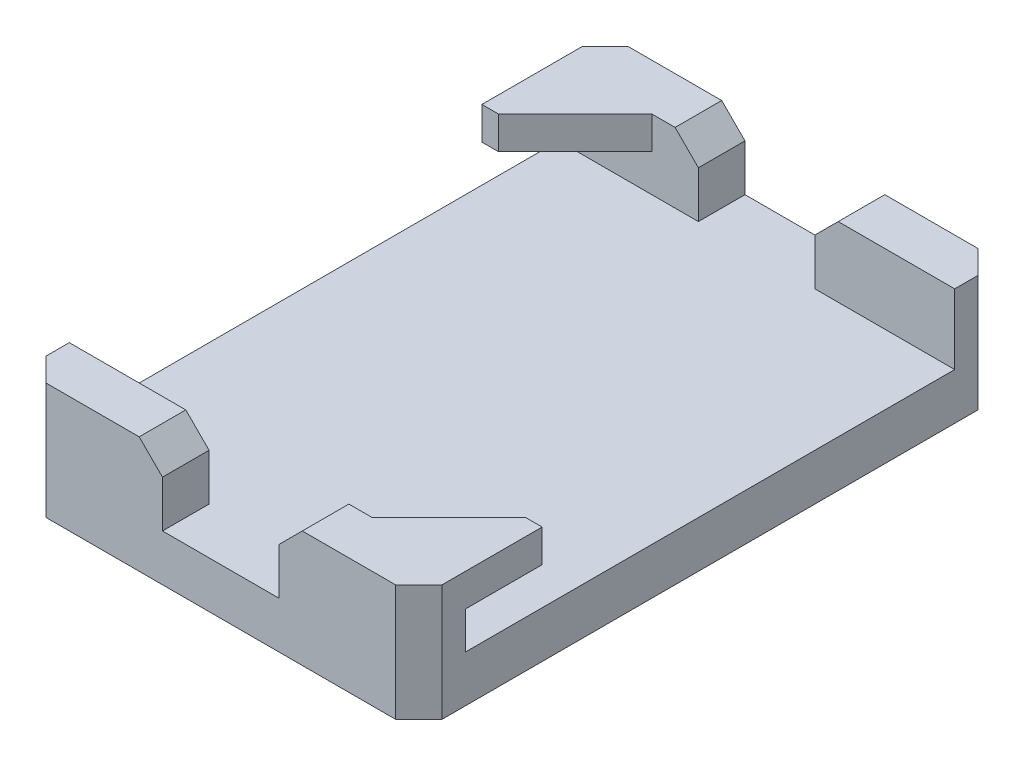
ISO-10303-21;
HEADER;
FILE_DESCRIPTION(('STEP AP214'),'2;1');
FILE_NAME('part.step','',(''),(''),'','','');
FILE_SCHEMA(('AUTOMOTIVE_DESIGN { 1 0 10303 214 1 1 1 1 }'));
ENDSEC;
DATA;
#1=APPLICATION_CONTEXT('core data for automotive mechanical design processes');
#2=APPLICATION_PROTOCOL_DEFINITION('international standard','automotive_design',2000,#1);
#3=PRODUCT_CONTEXT('',#1,'mechanical');
#4=PRODUCT('Part','Part','',(#3));
#5=PRODUCT_RELATED_PRODUCT_CATEGORY('part','',(#4));
#6=PRODUCT_DEFINITION_FORMATION('','',#4);
#7=PRODUCT_DEFINITION_CONTEXT('part definition',#1,'design');
#8=PRODUCT_DEFINITION('design','',#6,#7);
#9=PRODUCT_DEFINITION_SHAPE('','',#8);
#10=(LENGTH_UNIT() NAMED_UNIT(*) SI_UNIT(.MILLI.,.METRE.));
#11=(NAMED_UNIT(*) PLANE_ANGLE_UNIT() SI_UNIT($,.RADIAN.));
#12=(NAMED_UNIT(*) SI_UNIT($,.STERADIAN.) SOLID_ANGLE_UNIT());
#13=UNCERTAINTY_MEASURE_WITH_UNIT(LENGTH_MEASURE(1.E-05),#10,'distance_accuracy_value','');
#14=(GEOMETRIC_REPRESENTATION_CONTEXT(3) GLOBAL_UNCERTAINTY_ASSIGNED_CONTEXT((#13)) GLOBAL_UNIT_ASSIGNED_CONTEXT((#10,
#11,#12)) REPRESENTATION_CONTEXT('',''));
#15=CARTESIAN_POINT('',(0.,0.,0.));
#16=DIRECTION('',(0.,0.,1.));
#17=DIRECTION('',(1.,0.,0.));
#18=AXIS2_PLACEMENT_3D('',#15,#16,#17);
#19=CARTESIAN_POINT('',(2.5,4.,8.5));
#20=DIRECTION('',(0.707106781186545,-0.70710678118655,0.));
#21=DIRECTION('',(0.,0.,-1.));
#22=AXIS2_PLACEMENT_3D('',#19,#20,#21);
#23=PLANE('',#22);
#24=DIRECTION('',(-0.70710678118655,-0.707106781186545,0.));
#25=VECTOR('',#24,1.);
#26=CARTESIAN_POINT('',(-5.75,-4.25,12.5));
#27=LINE('',#26,#25);
#28=CARTESIAN_POINT('',(3.5,5.,12.5));
#29=VERTEX_POINT('',#28);
#30=CARTESIAN_POINT('',(2.5,4.,12.5));
#31=VERTEX_POINT('',#30);
#32=EDGE_CURVE('E518',#29,#31,#27,.T.);
#33=ORIENTED_EDGE('',*,*,#32,.F.);
#34=DIRECTION('',(0.,0.,1.));
#35=VECTOR('',#34,1.);
#36=CARTESIAN_POINT('',(3.5,5.,0.));
#37=LINE('',#36,#35);
#38=CARTESIAN_POINT('',(3.5,5.,10.5));
#39=VERTEX_POINT('',#38);
#40=EDGE_CURVE('E1941',#39,#29,#37,.T.);
#41=ORIENTED_EDGE('',*,*,#40,.F.);
#42=DIRECTION('',(0.70710678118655,0.707106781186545,0.));
#43=VECTOR('',#42,1.);
#44=CARTESIAN_POINT('',(-5.75,-4.25,10.5));
#45=LINE('',#44,#43);
#46=CARTESIAN_POINT('',(2.5,4.,10.5));
#47=VERTEX_POINT('',#46);
#48=EDGE_CURVE('E2050',#47,#39,#45,.T.);
#49=ORIENTED_EDGE('',*,*,#48,.F.);
#50=DIRECTION('',(0.,0.,-1.));
#51=VECTOR('',#50,1.);
#52=CARTESIAN_POINT('',(2.5,4.,8.5));
#53=LINE('',#52,#51);
#54=EDGE_CURVE('E624',#31,#47,#53,.T.);
#55=ORIENTED_EDGE('',*,*,#54,.F.);
#56=EDGE_LOOP('',(#33,#41,#49,#55));
#57=FACE_BOUND('',#56,.T.);
#58=ADVANCED_FACE('F16',(#57),#23,.F.);
#59=CARTESIAN_POINT('',(-3.5,5.,0.));
#60=DIRECTION('',(-0.70710678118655,-0.707106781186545,0.));
#61=DIRECTION('',(-0.707106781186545,0.70710678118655,0.));
#62=AXIS2_PLACEMENT_3D('',#59,#60,#61);
#63=PLANE('',#62);
#64=DIRECTION('',(-0.707106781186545,0.70710678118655,0.));
#65=VECTOR('',#64,1.);
#66=CARTESIAN_POINT('',(-4.25,5.75,12.5));
#67=LINE('',#66,#65);
#68=CARTESIAN_POINT('',(-2.5,4.,12.5));
#69=VERTEX_POINT('',#68);
#70=CARTESIAN_POINT('',(-3.5,5.,12.5));
#71=VERTEX_POINT('',#70);
#72=EDGE_CURVE('E507',#69,#71,#67,.T.);
#73=ORIENTED_EDGE('',*,*,#72,.F.);
#74=DIRECTION('',(0.,0.,1.));
#75=VECTOR('',#74,1.);
#76=CARTESIAN_POINT('',(-2.5,4.,8.5));
#77=LINE('',#76,#75);
#78=CARTESIAN_POINT('',(-2.5,4.,10.5));
#79=VERTEX_POINT('',#78);
#80=EDGE_CURVE('E627',#79,#69,#77,.T.);
#81=ORIENTED_EDGE('',*,*,#80,.F.);
#82=DIRECTION('',(0.707106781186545,-0.70710678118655,0.));
#83=VECTOR('',#82,1.);
#84=CARTESIAN_POINT('',(-4.25,5.75,10.5));
#85=LINE('',#84,#83);
#86=CARTESIAN_POINT('',(-3.5,5.,10.5));
#87=VERTEX_POINT('',#86);
#88=EDGE_CURVE('E495',#87,#79,#85,.T.);
#89=ORIENTED_EDGE('',*,*,#88,.F.);
#90=DIRECTION('',(0.,0.,-1.));
#91=VECTOR('',#90,1.);
#92=CARTESIAN_POINT('',(-3.5,5.,0.));
#93=LINE('',#92,#91);
#94=EDGE_CURVE('E555',#71,#87,#93,.T.);
#95=ORIENTED_EDGE('',*,*,#94,.F.);
#96=EDGE_LOOP('',(#73,#81,#89,#95));
#97=FACE_BOUND('',#96,.T.);
#98=ADVANCED_FACE('F925',(#97),#63,.F.);
#99=CARTESIAN_POINT('',(2.5,4.,-14.5));
#100=DIRECTION('',(-0.707106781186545,0.70710678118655,0.));
#101=DIRECTION('',(0.,0.,1.));
#102=AXIS2_PLACEMENT_3D('',#99,#100,#101);
#103=PLANE('',#102);
#104=DIRECTION('',(-0.70710678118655,-0.707106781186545,0.));
#105=VECTOR('',#104,1.);
#106=CARTESIAN_POINT('',(-5.75,-4.25,-10.5));
#107=LINE('',#106,#105);
#108=CARTESIAN_POINT('',(3.5,5.,-10.5));
#109=VERTEX_POINT('',#108);
#110=CARTESIAN_POINT('',(2.5,4.,-10.5));
#111=VERTEX_POINT('',#110);
#112=EDGE_CURVE('E2105',#109,#111,#107,.T.);
#113=ORIENTED_EDGE('',*,*,#112,.F.);
#114=DIRECTION('',(0.,0.,1.));
#115=VECTOR('',#114,1.);
#116=CARTESIAN_POINT('',(3.5,5.,-10.5));
#117=LINE('',#116,#115);
#118=CARTESIAN_POINT('',(3.5,5.,-12.5));
#119=VERTEX_POINT('',#118);
#120=EDGE_CURVE('E1956',#119,#109,#117,.T.);
#121=ORIENTED_EDGE('',*,*,#120,.F.);
#122=DIRECTION('',(0.70710678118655,0.707106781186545,0.));
#123=VECTOR('',#122,1.);
#124=CARTESIAN_POINT('',(-5.75,-4.25,-12.5));
#125=LINE('',#124,#123);
#126=CARTESIAN_POINT('',(2.5,4.,-12.5));
#127=VERTEX_POINT('',#126);
#128=EDGE_CURVE('E475',#127,#119,#125,.T.);
#129=ORIENTED_EDGE('',*,*,#128,.F.);
#130=DIRECTION('',(0.,0.,-1.));
#131=VECTOR('',#130,1.);
#132=CARTESIAN_POINT('',(2.5,4.,-12.5));
#133=LINE('',#132,#131);
#134=EDGE_CURVE('E25',#111,#127,#133,.T.);
#135=ORIENTED_EDGE('',*,*,#134,.F.);
#136=EDGE_LOOP('',(#113,#121,#129,#135));
#137=FACE_BOUND('',#136,.T.);
#138=ADVANCED_FACE('F920',(#137),#103,.T.);
#139=CARTESIAN_POINT('',(-2.5,4.,-14.5));
#140=DIRECTION('',(0.707106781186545,0.70710678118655,0.));
#141=DIRECTION('',(0.,0.,-1.));
#142=AXIS2_PLACEMENT_3D('',#139,#140,#141);
#143=PLANE('',#142);
#144=DIRECTION('',(0.70710678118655,-0.707106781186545,0.));
#145=VECTOR('',#144,1.);
#146=CARTESIAN_POINT('',(-4.25,5.75,-12.5));
#147=LINE('',#146,#145);
#148=CARTESIAN_POINT('',(-3.5,5.,-12.5));
#149=VERTEX_POINT('',#148);
#150=CARTESIAN_POINT('',(-2.5,4.,-12.5));
#151=VERTEX_POINT('',#150);
#152=EDGE_CURVE('E467',#149,#151,#147,.T.);
#153=ORIENTED_EDGE('',*,*,#152,.F.);
#154=DIRECTION('',(0.,0.,-1.));
#155=VECTOR('',#154,1.);
#156=CARTESIAN_POINT('',(-3.5,5.,-12.5));
#157=LINE('',#156,#155);
#158=CARTESIAN_POINT('',(-3.5,5.,-10.5));
#159=VERTEX_POINT('',#158);
#160=EDGE_CURVE('E548',#159,#149,#157,.T.);
#161=ORIENTED_EDGE('',*,*,#160,.F.);
#162=DIRECTION('',(-0.70710678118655,0.707106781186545,0.));
#163=VECTOR('',#162,1.);
#164=CARTESIAN_POINT('',(-4.25,5.75,-10.5));
#165=LINE('',#164,#163);
#166=CARTESIAN_POINT('',(-2.5,4.,-10.5));
#167=VERTEX_POINT('',#166);
#168=EDGE_CURVE('E446',#167,#159,#165,.T.);
#169=ORIENTED_EDGE('',*,*,#168,.F.);
#170=DIRECTION('',(0.,0.,1.));
#171=VECTOR('',#170,1.);
#172=CARTESIAN_POINT('',(-2.5,4.,-10.5));
#173=LINE('',#172,#171);
#174=EDGE_CURVE('E11',#151,#167,#173,.T.);
#175=ORIENTED_EDGE('',*,*,#174,.F.);
#176=EDGE_LOOP('',(#153,#161,#169,#175));
#177=FACE_BOUND('',#176,.T.);
#178=ADVANCED_FACE('F924',(#177),#143,.T.);
#179=CARTESIAN_POINT('',(-2.5,2.,-14.5));
#180=DIRECTION('',(-1.,0.,0.));
#181=DIRECTION('',(0.,0.,1.));
#182=AXIS2_PLACEMENT_3D('',#179,#180,#181);
#183=PLANE('',#182);
#184=DIRECTION('',(0.,1.,0.));
#185=VECTOR('',#184,1.);
#186=CARTESIAN_POINT('',(-2.5,0.,-12.5));
#187=LINE('',#186,#185);
#188=CARTESIAN_POINT('',(-2.5,2.,-12.5));
#189=VERTEX_POINT('',#188);
#190=EDGE_CURVE('E471',#189,#151,#187,.T.);
#191=ORIENTED_EDGE('',*,*,#190,.T.);
#192=ORIENTED_EDGE('',*,*,#174,.T.);
#193=DIRECTION('',(0.,1.,0.));
#194=VECTOR('',#193,1.);
#195=CARTESIAN_POINT('',(-2.5,2.,-10.5));
#196=LINE('',#195,#194);
#197=CARTESIAN_POINT('',(-2.5,2.,-10.5));
#198=VERTEX_POINT('',#197);
#199=EDGE_CURVE('E444',#198,#167,#196,.T.);
#200=ORIENTED_EDGE('',*,*,#199,.F.);
#201=DIRECTION('',(0.,0.,1.));
#202=VECTOR('',#201,1.);
#203=CARTESIAN_POINT('',(-2.5,2.,-14.5));
#204=LINE('',#203,#202);
#205=EDGE_CURVE('E673',#189,#198,#204,.T.);
#206=ORIENTED_EDGE('',*,*,#205,.F.);
#207=EDGE_LOOP('',(#191,#192,#200,#206));
#208=FACE_BOUND('',#207,.T.);
#209=ADVANCED_FACE('F984',(#208),#183,.F.);
#210=CARTESIAN_POINT('',(2.5,2.,-14.5));
#211=DIRECTION('',(1.,0.,0.));
#212=DIRECTION('',(0.,1.,0.));
#213=AXIS2_PLACEMENT_3D('',#210,#211,#212);
#214=PLANE('',#213);
#215=DIRECTION('',(0.,1.,0.));
#216=VECTOR('',#215,1.);
#217=CARTESIAN_POINT('',(2.5,2.,-10.5));
#218=LINE('',#217,#216);
#219=CARTESIAN_POINT('',(2.5,2.,-10.5));
#220=VERTEX_POINT('',#219);
#221=EDGE_CURVE('E2099',#220,#111,#218,.T.);
#222=ORIENTED_EDGE('',*,*,#221,.T.);
#223=ORIENTED_EDGE('',*,*,#134,.T.);
#224=DIRECTION('',(0.,-1.,0.));
#225=VECTOR('',#224,1.);
#226=CARTESIAN_POINT('',(2.5,0.,-12.5));
#227=LINE('',#226,#225);
#228=CARTESIAN_POINT('',(2.5,2.,-12.5));
#229=VERTEX_POINT('',#228);
#230=EDGE_CURVE('E472',#127,#229,#227,.T.);
#231=ORIENTED_EDGE('',*,*,#230,.T.);
#232=DIRECTION('',(0.,0.,-1.));
#233=VECTOR('',#232,1.);
#234=CARTESIAN_POINT('',(2.5,2.,-14.5));
#235=LINE('',#234,#233);
#236=EDGE_CURVE('E665',#220,#229,#235,.T.);
#237=ORIENTED_EDGE('',*,*,#236,.F.);
#238=EDGE_LOOP('',(#222,#223,#231,#237));
#239=FACE_BOUND('',#238,.T.);
#240=ADVANCED_FACE('F979',(#239),#214,.F.);
#241=CARTESIAN_POINT('',(-2.5,2.,8.5));
#242=DIRECTION('',(-1.,0.,0.));
#243=DIRECTION('',(0.,1.,0.));
#244=AXIS2_PLACEMENT_3D('',#241,#242,#243);
#245=PLANE('',#244);
#246=DIRECTION('',(0.,1.,0.));
#247=VECTOR('',#246,1.);
#248=CARTESIAN_POINT('',(-2.5,0.,10.5));
#249=LINE('',#248,#247);
#250=CARTESIAN_POINT('',(-2.5,2.,10.5));
#251=VERTEX_POINT('',#250);
#252=EDGE_CURVE('E499',#251,#79,#249,.T.);
#253=ORIENTED_EDGE('',*,*,#252,.T.);
#254=ORIENTED_EDGE('',*,*,#80,.T.);
#255=DIRECTION('',(0.,1.,0.));
#256=VECTOR('',#255,1.);
#257=CARTESIAN_POINT('',(-2.5,2.,12.5));
#258=LINE('',#257,#256);
#259=CARTESIAN_POINT('',(-2.5,2.,12.5));
#260=VERTEX_POINT('',#259);
#261=EDGE_CURVE('E503',#260,#69,#258,.T.);
#262=ORIENTED_EDGE('',*,*,#261,.F.);
#263=DIRECTION('',(0.,0.,1.));
#264=VECTOR('',#263,1.);
#265=CARTESIAN_POINT('',(-2.5,2.,8.5));
#266=LINE('',#265,#264);
#267=EDGE_CURVE('E648',#251,#260,#266,.T.);
#268=ORIENTED_EDGE('',*,*,#267,.F.);
#269=EDGE_LOOP('',(#253,#254,#262,#268));
#270=FACE_BOUND('',#269,.T.);
#271=ADVANCED_FACE('F983',(#270),#245,.F.);
#272=CARTESIAN_POINT('',(2.5,2.,8.5));
#273=DIRECTION('',(1.,0.,0.));
#274=DIRECTION('',(0.,1.,0.));
#275=AXIS2_PLACEMENT_3D('',#272,#273,#274);
#276=PLANE('',#275);
#277=DIRECTION('',(0.,1.,0.));
#278=VECTOR('',#277,1.);
#279=CARTESIAN_POINT('',(2.5,2.,12.5));
#280=LINE('',#279,#278);
#281=CARTESIAN_POINT('',(2.5,2.,12.5));
#282=VERTEX_POINT('',#281);
#283=EDGE_CURVE('E522',#282,#31,#280,.T.);
#284=ORIENTED_EDGE('',*,*,#283,.T.);
#285=ORIENTED_EDGE('',*,*,#54,.T.);
#286=DIRECTION('',(0.,-1.,0.));
#287=VECTOR('',#286,1.);
#288=CARTESIAN_POINT('',(2.5,0.,10.5));
#289=LINE('',#288,#287);
#290=CARTESIAN_POINT('',(2.5,2.,10.5));
#291=VERTEX_POINT('',#290);
#292=EDGE_CURVE('E2062',#47,#291,#289,.T.);
#293=ORIENTED_EDGE('',*,*,#292,.T.);
#294=DIRECTION('',(0.,0.,-1.));
#295=VECTOR('',#294,1.);
#296=CARTESIAN_POINT('',(2.5,2.,8.5));
#297=LINE('',#296,#295);
#298=EDGE_CURVE('E656',#282,#291,#297,.T.);
#299=ORIENTED_EDGE('',*,*,#298,.F.);
#300=EDGE_LOOP('',(#284,#285,#293,#299));
#301=FACE_BOUND('',#300,.T.);
#302=ADVANCED_FACE('F1292',(#301),#276,.F.);
#303=CARTESIAN_POINT('',(7.5,0.,12.5));
#304=DIRECTION('',(-0.707106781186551,0.,-0.707106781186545));
#305=DIRECTION('',(-0.707106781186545,0.,0.707106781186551));
#306=AXIS2_PLACEMENT_3D('',#303,#304,#305);
#307=PLANE('',#306);
#308=DIRECTION('',(-0.707106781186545,0.,0.707106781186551));
#309=VECTOR('',#308,1.);
#310=CARTESIAN_POINT('',(7.5,0.,12.5));
#311=LINE('',#310,#309);
#312=CARTESIAN_POINT('',(8.5,0.,11.5));
#313=VERTEX_POINT('',#312);
#314=CARTESIAN_POINT('',(7.5,0.,12.5));
#315=VERTEX_POINT('',#314);
#316=EDGE_CURVE('E1709',#313,#315,#311,.T.);
#317=ORIENTED_EDGE('',*,*,#316,.F.);
#318=DIRECTION('',(0.,-1.,0.));
#319=VECTOR('',#318,1.);
#320=CARTESIAN_POINT('',(8.5,13.,11.5));
#321=LINE('',#320,#319);
#322=CARTESIAN_POINT('',(8.5,5.,11.5));
#323=VERTEX_POINT('',#322);
#324=EDGE_CURVE('E617',#323,#313,#321,.T.);
#325=ORIENTED_EDGE('',*,*,#324,.F.);
#326=DIRECTION('',(0.707106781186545,0.,-0.707106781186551));
#327=VECTOR('',#326,1.);
#328=CARTESIAN_POINT('',(7.5,5.,12.5));
#329=LINE('',#328,#327);
#330=CARTESIAN_POINT('',(7.5,5.,12.5));
#331=VERTEX_POINT('',#330);
#332=EDGE_CURVE('E1922',#331,#323,#329,.T.);
#333=ORIENTED_EDGE('',*,*,#332,.F.);
#334=DIRECTION('',(0.,1.,0.));
#335=VECTOR('',#334,1.);
#336=CARTESIAN_POINT('',(7.5,0.,12.5));
#337=LINE('',#336,#335);
#338=EDGE_CURVE('E523',#315,#331,#337,.T.);
#339=ORIENTED_EDGE('',*,*,#338,.F.);
#340=EDGE_LOOP('',(#317,#325,#333,#339));
#341=FACE_BOUND('',#340,.T.);
#342=ADVANCED_FACE('F1283',(#341),#307,.F.);
#343=CARTESIAN_POINT('',(-8.5,13.,11.5));
#344=DIRECTION('',(-0.707106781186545,0.,0.70710678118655));
#345=DIRECTION('',(0.,1.,0.));
#346=AXIS2_PLACEMENT_3D('',#343,#344,#345);
#347=PLANE('',#346);
#348=DIRECTION('',(-0.70710678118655,0.,-0.707106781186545));
#349=VECTOR('',#348,1.);
#350=CARTESIAN_POINT('',(-8.5,0.,11.5));
#351=LINE('',#350,#349);
#352=CARTESIAN_POINT('',(-7.5,0.,12.5));
#353=VERTEX_POINT('',#352);
#354=CARTESIAN_POINT('',(-8.5,0.,11.5));
#355=VERTEX_POINT('',#354);
#356=EDGE_CURVE('E1716',#353,#355,#351,.T.);
#357=ORIENTED_EDGE('',*,*,#356,.F.);
#358=DIRECTION('',(0.,-1.,0.));
#359=VECTOR('',#358,1.);
#360=CARTESIAN_POINT('',(-7.5,0.,12.5));
#361=LINE('',#360,#359);
#362=CARTESIAN_POINT('',(-7.5,5.,12.5));
#363=VERTEX_POINT('',#362);
#364=EDGE_CURVE('E674',#363,#353,#361,.T.);
#365=ORIENTED_EDGE('',*,*,#364,.F.);
#366=DIRECTION('',(0.70710678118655,0.,0.707106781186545));
#367=VECTOR('',#366,1.);
#368=CARTESIAN_POINT('',(-8.5,5.,11.5));
#369=LINE('',#368,#367);
#370=CARTESIAN_POINT('',(-8.5,5.,11.5));
#371=VERTEX_POINT('',#370);
#372=EDGE_CURVE('E561',#371,#363,#369,.T.);
#373=ORIENTED_EDGE('',*,*,#372,.F.);
#374=DIRECTION('',(0.,1.,0.));
#375=VECTOR('',#374,1.);
#376=CARTESIAN_POINT('',(-8.5,5.,11.5));
#377=LINE('',#376,#375);
#378=EDGE_CURVE('E608',#355,#371,#377,.T.);
#379=ORIENTED_EDGE('',*,*,#378,.F.);
#380=EDGE_LOOP('',(#357,#365,#373,#379));
#381=FACE_BOUND('',#380,.T.);
#382=ADVANCED_FACE('F1274',(#381),#347,.T.);
#383=CARTESIAN_POINT('',(7.5,0.,-12.5));
#384=DIRECTION('',(-0.707106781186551,0.,0.707106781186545));
#385=DIRECTION('',(0.,1.,0.));
#386=AXIS2_PLACEMENT_3D('',#383,#384,#385);
#387=PLANE('',#386);
#388=DIRECTION('',(-0.707106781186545,0.,-0.707106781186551));
#389=VECTOR('',#388,1.);
#390=CARTESIAN_POINT('',(10.,5.,-10.));
#391=LINE('',#390,#389);
#392=CARTESIAN_POINT('',(8.5,5.,-11.5));
#393=VERTEX_POINT('',#392);
#394=CARTESIAN_POINT('',(7.5,5.,-12.5));
#395=VERTEX_POINT('',#394);
#396=EDGE_CURVE('E1948',#393,#395,#391,.T.);
#397=ORIENTED_EDGE('',*,*,#396,.F.);
#398=DIRECTION('',(0.,1.,0.));
#399=VECTOR('',#398,1.);
#400=CARTESIAN_POINT('',(8.5,13.,-11.5));
#401=LINE('',#400,#399);
#402=CARTESIAN_POINT('',(8.5,0.,-11.5));
#403=VERTEX_POINT('',#402);
#404=EDGE_CURVE('E611',#403,#393,#401,.T.);
#405=ORIENTED_EDGE('',*,*,#404,.F.);
#406=DIRECTION('',(0.707106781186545,0.,0.707106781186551));
#407=VECTOR('',#406,1.);
#408=CARTESIAN_POINT('',(7.5,0.,-12.5));
#409=LINE('',#408,#407);
#410=CARTESIAN_POINT('',(7.5,0.,-12.5));
#411=VERTEX_POINT('',#410);
#412=EDGE_CURVE('E1693',#411,#403,#409,.T.);
#413=ORIENTED_EDGE('',*,*,#412,.F.);
#414=DIRECTION('',(0.,-1.,0.));
#415=VECTOR('',#414,1.);
#416=CARTESIAN_POINT('',(7.5,0.,-12.5));
#417=LINE('',#416,#415);
#418=EDGE_CURVE('E484',#395,#411,#417,.T.);
#419=ORIENTED_EDGE('',*,*,#418,.F.);
#420=EDGE_LOOP('',(#397,#405,#413,#419));
#421=FACE_BOUND('',#420,.T.);
#422=ADVANCED_FACE('F1265',(#421),#387,.F.);
#423=CARTESIAN_POINT('',(-8.5,13.,-11.5));
#424=DIRECTION('',(-0.707106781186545,0.,-0.70710678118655));
#425=DIRECTION('',(-0.70710678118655,0.,0.707106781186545));
#426=AXIS2_PLACEMENT_3D('',#423,#424,#425);
#427=PLANE('',#426);
#428=DIRECTION('',(-0.70710678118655,0.,0.707106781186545));
#429=VECTOR('',#428,1.);
#430=CARTESIAN_POINT('',(-10.,5.,-10.));
#431=LINE('',#430,#429);
#432=CARTESIAN_POINT('',(-7.5,5.,-12.5));
#433=VERTEX_POINT('',#432);
#434=CARTESIAN_POINT('',(-8.5,5.,-11.5));
#435=VERTEX_POINT('',#434);
#436=EDGE_CURVE('E551',#433,#435,#431,.T.);
#437=ORIENTED_EDGE('',*,*,#436,.F.);
#438=DIRECTION('',(0.,1.,0.));
#439=VECTOR('',#438,1.);
#440=CARTESIAN_POINT('',(-7.5,5.,-12.5));
#441=LINE('',#440,#439);
#442=CARTESIAN_POINT('',(-7.5,0.,-12.5));
#443=VERTEX_POINT('',#442);
#444=EDGE_CURVE('E487',#443,#433,#441,.T.);
#445=ORIENTED_EDGE('',*,*,#444,.F.);
#446=DIRECTION('',(0.70710678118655,0.,-0.707106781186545));
#447=VECTOR('',#446,1.);
#448=CARTESIAN_POINT('',(-8.5,0.,-11.5));
#449=LINE('',#448,#447);
#450=CARTESIAN_POINT('',(-8.5,0.,-11.5));
#451=VERTEX_POINT('',#450);
#452=EDGE_CURVE('E1681',#451,#443,#449,.T.);
#453=ORIENTED_EDGE('',*,*,#452,.F.);
#454=DIRECTION('',(0.,-1.,0.));
#455=VECTOR('',#454,1.);
#456=CARTESIAN_POINT('',(-8.5,0.,-11.5));
#457=LINE('',#456,#455);
#458=EDGE_CURVE('E605',#435,#451,#457,.T.);
#459=ORIENTED_EDGE('',*,*,#458,.F.);
#460=EDGE_LOOP('',(#437,#445,#453,#459));
#461=FACE_BOUND('',#460,.T.);
#462=ADVANCED_FACE('F1248',(#461),#427,.T.);
#463=CARTESIAN_POINT('',(8.5,13.,7.20710678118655));
#464=DIRECTION('',(0.,0.,1.));
#465=DIRECTION('',(1.,0.,0.));
#466=AXIS2_PLACEMENT_3D('',#463,#464,#465);
#467=PLANE('',#466);
#468=DIRECTION('',(1.,0.,0.));
#469=VECTOR('',#468,1.);
#470=CARTESIAN_POINT('',(0.,3.6,7.20710678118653));
#471=LINE('',#470,#469);
#472=CARTESIAN_POINT('',(7.79289321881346,3.6,7.20710678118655));
#473=VERTEX_POINT('',#472);
#474=CARTESIAN_POINT('',(8.5,3.6,7.20710678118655));
#475=VERTEX_POINT('',#474);
#476=EDGE_CURVE('E512',#473,#475,#471,.T.);
#477=ORIENTED_EDGE('',*,*,#476,.F.);
#478=DIRECTION('',(0.,-1.,0.));
#479=VECTOR('',#478,1.);
#480=CARTESIAN_POINT('',(7.79289321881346,3.6,7.20710678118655));
#481=LINE('',#480,#479);
#482=CARTESIAN_POINT('',(7.79289321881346,5.,7.20710678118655));
#483=VERTEX_POINT('',#482);
#484=EDGE_CURVE('E621',#483,#473,#481,.T.);
#485=ORIENTED_EDGE('',*,*,#484,.F.);
#486=DIRECTION('',(-1.,0.,0.));
#487=VECTOR('',#486,1.);
#488=CARTESIAN_POINT('',(8.5,5.,7.20710678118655));
#489=LINE('',#488,#487);
#490=CARTESIAN_POINT('',(8.5,5.,7.20710678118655));
#491=VERTEX_POINT('',#490);
#492=EDGE_CURVE('E1677',#491,#483,#489,.T.);
#493=ORIENTED_EDGE('',*,*,#492,.F.);
#494=DIRECTION('',(0.,1.,0.));
#495=VECTOR('',#494,1.);
#496=CARTESIAN_POINT('',(8.5,13.,7.20710678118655));
#497=LINE('',#496,#495);
#498=EDGE_CURVE('E614',#475,#491,#497,.T.);
#499=ORIENTED_EDGE('',*,*,#498,.F.);
#500=EDGE_LOOP('',(#477,#485,#493,#499));
#501=FACE_BOUND('',#500,.T.);
#502=ADVANCED_FACE('F1240',(#501),#467,.F.);
#503=CARTESIAN_POINT('',(-8.5,13.,-7.20710678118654));
#504=DIRECTION('',(0.,0.,1.));
#505=DIRECTION('',(1.,0.,0.));
#506=AXIS2_PLACEMENT_3D('',#503,#504,#505);
#507=PLANE('',#506);
#508=DIRECTION('',(-1.,0.,0.));
#509=VECTOR('',#508,1.);
#510=CARTESIAN_POINT('',(0.,3.6,-7.20710678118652));
#511=LINE('',#510,#509);
#512=CARTESIAN_POINT('',(-7.79289321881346,3.6,-7.20710678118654));
#513=VERTEX_POINT('',#512);
#514=CARTESIAN_POINT('',(-8.5,3.6,-7.20710678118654));
#515=VERTEX_POINT('',#514);
#516=EDGE_CURVE('E534',#513,#515,#511,.T.);
#517=ORIENTED_EDGE('',*,*,#516,.F.);
#518=DIRECTION('',(0.,-1.,0.));
#519=VECTOR('',#518,1.);
#520=CARTESIAN_POINT('',(-7.79289321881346,3.6,-7.20710678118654));
#521=LINE('',#520,#519);
#522=CARTESIAN_POINT('',(-7.79289321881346,5.,-7.20710678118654));
#523=VERTEX_POINT('',#522);
#524=EDGE_CURVE('E618',#523,#513,#521,.T.);
#525=ORIENTED_EDGE('',*,*,#524,.F.);
#526=DIRECTION('',(1.,0.,0.));
#527=VECTOR('',#526,1.);
#528=CARTESIAN_POINT('',(0.,5.,-7.20710678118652));
#529=LINE('',#528,#527);
#530=CARTESIAN_POINT('',(-8.5,5.,-7.20710678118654));
#531=VERTEX_POINT('',#530);
#532=EDGE_CURVE('E556',#531,#523,#529,.T.);
#533=ORIENTED_EDGE('',*,*,#532,.F.);
#534=DIRECTION('',(0.,1.,0.));
#535=VECTOR('',#534,1.);
#536=CARTESIAN_POINT('',(-8.5,5.,-7.20710678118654));
#537=LINE('',#536,#535);
#538=EDGE_CURVE('E39',#515,#531,#537,.T.);
#539=ORIENTED_EDGE('',*,*,#538,.F.);
#540=EDGE_LOOP('',(#517,#525,#533,#539));
#541=FACE_BOUND('',#540,.T.);
#542=ADVANCED_FACE('F1231',(#541),#507,.T.);
#543=CARTESIAN_POINT('',(4.5,3.6,10.5));
#544=DIRECTION('',(-0.707106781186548,0.,-0.707106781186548));
#545=DIRECTION('',(-0.707106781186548,0.,0.707106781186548));
#546=AXIS2_PLACEMENT_3D('',#543,#544,#545);
#547=PLANE('',#546);
#548=DIRECTION('',(-0.707106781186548,0.,0.707106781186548));
#549=VECTOR('',#548,1.);
#550=CARTESIAN_POINT('',(4.5,5.,10.5));
#551=LINE('',#550,#549);
#552=CARTESIAN_POINT('',(4.5,5.,10.5));
#553=VERTEX_POINT('',#552);
#554=EDGE_CURVE('E1673',#483,#553,#551,.T.);
#555=ORIENTED_EDGE('',*,*,#554,.F.);
#556=ORIENTED_EDGE('',*,*,#484,.T.);
#557=DIRECTION('',(-0.707106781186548,0.,0.707106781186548));
#558=VECTOR('',#557,1.);
#559=CARTESIAN_POINT('',(4.5,3.6,10.5));
#560=LINE('',#559,#558);
#561=CARTESIAN_POINT('',(4.5,3.6,10.5));
#562=VERTEX_POINT('',#561);
#563=EDGE_CURVE('E517',#473,#562,#560,.T.);
#564=ORIENTED_EDGE('',*,*,#563,.T.);
#565=DIRECTION('',(0.,1.,0.));
#566=VECTOR('',#565,1.);
#567=CARTESIAN_POINT('',(4.5,3.6,10.5));
#568=LINE('',#567,#566);
#569=EDGE_CURVE('E1985',#562,#553,#568,.T.);
#570=ORIENTED_EDGE('',*,*,#569,.T.);
#571=EDGE_LOOP('',(#555,#556,#564,#570));
#572=FACE_BOUND('',#571,.T.);
#573=ADVANCED_FACE('F1222',(#572),#547,.T.);
#574=CARTESIAN_POINT('',(-8.5,3.6,-6.5));
#575=DIRECTION('',(0.707106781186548,0.,0.707106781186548));
#576=DIRECTION('',(0.,-1.,0.));
#577=AXIS2_PLACEMENT_3D('',#574,#575,#576);
#578=PLANE('',#577);
#579=DIRECTION('',(0.707106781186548,0.,-0.707106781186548));
#580=VECTOR('',#579,1.);
#581=CARTESIAN_POINT('',(-8.5,5.,-6.5));
#582=LINE('',#581,#580);
#583=CARTESIAN_POINT('',(-4.5,5.,-10.5));
#584=VERTEX_POINT('',#583);
#585=EDGE_CURVE('E552',#523,#584,#582,.T.);
#586=ORIENTED_EDGE('',*,*,#585,.F.);
#587=ORIENTED_EDGE('',*,*,#524,.T.);
#588=DIRECTION('',(0.707106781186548,0.,-0.707106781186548));
#589=VECTOR('',#588,1.);
#590=CARTESIAN_POINT('',(-8.5,3.6,-6.5));
#591=LINE('',#590,#589);
#592=CARTESIAN_POINT('',(-4.5,3.6,-10.5));
#593=VERTEX_POINT('',#592);
#594=EDGE_CURVE('E453',#513,#593,#591,.T.);
#595=ORIENTED_EDGE('',*,*,#594,.T.);
#596=DIRECTION('',(0.,1.,0.));
#597=VECTOR('',#596,1.);
#598=CARTESIAN_POINT('',(-4.5,3.6,-10.5));
#599=LINE('',#598,#597);
#600=EDGE_CURVE('E454',#593,#584,#599,.T.);
#601=ORIENTED_EDGE('',*,*,#600,.T.);
#602=EDGE_LOOP('',(#586,#587,#595,#601));
#603=FACE_BOUND('',#602,.T.);
#604=ADVANCED_FACE('F1213',(#603),#578,.T.);
#605=CARTESIAN_POINT('',(8.5,13.,0.));
#606=DIRECTION('',(1.,0.,0.));
#607=DIRECTION('',(0.,1.,0.));
#608=AXIS2_PLACEMENT_3D('',#605,#606,#607);
#609=PLANE('',#608);
#610=DIRECTION('',(0.,0.,-1.));
#611=VECTOR('',#610,1.);
#612=CARTESIAN_POINT('',(8.5,0.,0.));
#613=LINE('',#612,#611);
#614=EDGE_CURVE('E1705',#313,#403,#613,.T.);
#615=ORIENTED_EDGE('',*,*,#614,.T.);
#616=ORIENTED_EDGE('',*,*,#404,.T.);
#617=DIRECTION('',(0.,0.,-1.));
#618=VECTOR('',#617,1.);
#619=CARTESIAN_POINT('',(8.5,5.,0.));
#620=LINE('',#619,#618);
#621=CARTESIAN_POINT('',(8.5,5.,-10.5));
#622=VERTEX_POINT('',#621);
#623=EDGE_CURVE('E1969',#622,#393,#620,.T.);
#624=ORIENTED_EDGE('',*,*,#623,.F.);
#625=DIRECTION('',(0.,1.,0.));
#626=VECTOR('',#625,1.);
#627=CARTESIAN_POINT('',(8.5,0.,-10.5));
#628=LINE('',#627,#626);
#629=CARTESIAN_POINT('',(8.5,2.,-10.5));
#630=VERTEX_POINT('',#629);
#631=EDGE_CURVE('E2080',#630,#622,#628,.T.);
#632=ORIENTED_EDGE('',*,*,#631,.F.);
#633=DIRECTION('',(0.,0.,-1.));
#634=VECTOR('',#633,1.);
#635=CARTESIAN_POINT('',(8.5,2.,0.));
#636=LINE('',#635,#634);
#637=CARTESIAN_POINT('',(8.5,2.,10.5));
#638=VERTEX_POINT('',#637);
#639=EDGE_CURVE('E659',#638,#630,#636,.T.);
#640=ORIENTED_EDGE('',*,*,#639,.F.);
#641=DIRECTION('',(0.,-1.,0.));
#642=VECTOR('',#641,1.);
#643=CARTESIAN_POINT('',(8.5,0.,10.5));
#644=LINE('',#643,#642);
#645=CARTESIAN_POINT('',(8.5,3.6,10.5));
#646=VERTEX_POINT('',#645);
#647=EDGE_CURVE('E1984',#646,#638,#644,.T.);
#648=ORIENTED_EDGE('',*,*,#647,.F.);
#649=DIRECTION('',(0.,0.,1.));
#650=VECTOR('',#649,1.);
#651=CARTESIAN_POINT('',(8.5,3.6,0.));
#652=LINE('',#651,#650);
#653=EDGE_CURVE('E516',#475,#646,#652,.T.);
#654=ORIENTED_EDGE('',*,*,#653,.F.);
#655=ORIENTED_EDGE('',*,*,#498,.T.);
#656=DIRECTION('',(0.,0.,1.));
#657=VECTOR('',#656,1.);
#658=CARTESIAN_POINT('',(8.5,5.,0.));
#659=LINE('',#658,#657);
#660=EDGE_CURVE('E1916',#491,#323,#659,.T.);
#661=ORIENTED_EDGE('',*,*,#660,.T.);
#662=ORIENTED_EDGE('',*,*,#324,.T.);
#663=EDGE_LOOP('',(#615,#616,#624,#632,#640,#648,#654,#655,#661,#662));
#664=FACE_BOUND('',#663,.T.);
#665=ADVANCED_FACE('F1205',(#664),#609,.T.);
#666=CARTESIAN_POINT('',(-8.5,13.,0.));
#667=DIRECTION('',(1.,0.,0.));
#668=DIRECTION('',(0.,1.,0.));
#669=AXIS2_PLACEMENT_3D('',#666,#667,#668);
#670=PLANE('',#669);
#671=DIRECTION('',(0.,0.,-1.));
#672=VECTOR('',#671,1.);
#673=CARTESIAN_POINT('',(-8.5,5.,0.));
#674=LINE('',#673,#672);
#675=EDGE_CURVE('E1685',#531,#435,#674,.T.);
#676=ORIENTED_EDGE('',*,*,#675,.T.);
#677=ORIENTED_EDGE('',*,*,#458,.T.);
#678=DIRECTION('',(0.,0.,-1.));
#679=VECTOR('',#678,1.);
#680=CARTESIAN_POINT('',(-8.5,0.,0.));
#681=LINE('',#680,#679);
#682=EDGE_CURVE('E1676',#355,#451,#681,.T.);
#683=ORIENTED_EDGE('',*,*,#682,.F.);
#684=ORIENTED_EDGE('',*,*,#378,.T.);
#685=DIRECTION('',(0.,0.,1.));
#686=VECTOR('',#685,1.);
#687=CARTESIAN_POINT('',(-8.5,5.,0.));
#688=LINE('',#687,#686);
#689=CARTESIAN_POINT('',(-8.5,5.,10.5));
#690=VERTEX_POINT('',#689);
#691=EDGE_CURVE('E557',#690,#371,#688,.T.);
#692=ORIENTED_EDGE('',*,*,#691,.F.);
#693=DIRECTION('',(0.,-1.,0.));
#694=VECTOR('',#693,1.);
#695=CARTESIAN_POINT('',(-8.5,0.,10.5));
#696=LINE('',#695,#694);
#697=CARTESIAN_POINT('',(-8.5,2.,10.5));
#698=VERTEX_POINT('',#697);
#699=EDGE_CURVE('E500',#690,#698,#696,.T.);
#700=ORIENTED_EDGE('',*,*,#699,.T.);
#701=DIRECTION('',(0.,0.,-1.));
#702=VECTOR('',#701,1.);
#703=CARTESIAN_POINT('',(-8.5,2.,0.));
#704=LINE('',#703,#702);
#705=CARTESIAN_POINT('',(-8.5,2.,-10.5));
#706=VERTEX_POINT('',#705);
#707=EDGE_CURVE('E685',#698,#706,#704,.T.);
#708=ORIENTED_EDGE('',*,*,#707,.T.);
#709=DIRECTION('',(0.,1.,0.));
#710=VECTOR('',#709,1.);
#711=CARTESIAN_POINT('',(-8.5,0.,-10.5));
#712=LINE('',#711,#710);
#713=CARTESIAN_POINT('',(-8.5,3.6,-10.5));
#714=VERTEX_POINT('',#713);
#715=EDGE_CURVE('E459',#706,#714,#712,.T.);
#716=ORIENTED_EDGE('',*,*,#715,.T.);
#717=DIRECTION('',(0.,0.,1.));
#718=VECTOR('',#717,1.);
#719=CARTESIAN_POINT('',(-8.5,3.6,0.));
#720=LINE('',#719,#718);
#721=EDGE_CURVE('E604',#714,#515,#720,.T.);
#722=ORIENTED_EDGE('',*,*,#721,.T.);
#723=ORIENTED_EDGE('',*,*,#538,.T.);
#724=EDGE_LOOP('',(#676,#677,#683,#684,#692,#700,#708,#716,#722,#723));
#725=FACE_BOUND('',#724,.T.);
#726=ADVANCED_FACE('F703',(#725),#670,.F.);
#727=CARTESIAN_POINT('',(0.,3.6,0.));
#728=DIRECTION('',(0.,-1.,0.));
#729=DIRECTION('',(0.,0.,-1.));
#730=AXIS2_PLACEMENT_3D('',#727,#728,#729);
#731=PLANE('',#730);
#732=ORIENTED_EDGE('',*,*,#594,.F.);
#733=ORIENTED_EDGE('',*,*,#516,.T.);
#734=ORIENTED_EDGE('',*,*,#721,.F.);
#735=DIRECTION('',(-1.,0.,0.));
#736=VECTOR('',#735,1.);
#737=CARTESIAN_POINT('',(-10.,3.6,-10.5));
#738=LINE('',#737,#736);
#739=EDGE_CURVE('E458',#593,#714,#738,.T.);
#740=ORIENTED_EDGE('',*,*,#739,.F.);
#741=EDGE_LOOP('',(#732,#733,#734,#740));
#742=FACE_BOUND('',#741,.T.);
#743=ADVANCED_FACE('F700',(#742),#731,.T.);
#744=CARTESIAN_POINT('',(4.1,-3.5,5.8));
#745=DIRECTION('',(-0.707106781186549,0.707106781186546,0.));
#746=DIRECTION('',(0.,0.,1.));
#747=AXIS2_PLACEMENT_3D('',#744,#745,#746);
#748=PLANE('',#747);
#749=DIRECTION('',(0.577350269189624,0.577350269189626,-0.577350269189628));
#750=VECTOR('',#749,1.);
#751=CARTESIAN_POINT('',(3.1,-4.5,5.8));
#752=LINE('',#751,#750);
#753=CARTESIAN_POINT('',(3.1,-4.5,5.8));
#754=VERTEX_POINT('',#753);
#755=CARTESIAN_POINT('',(4.1,-3.5,4.8));
#756=VERTEX_POINT('',#755);
#757=EDGE_CURVE('E411',#754,#756,#752,.T.);
#758=ORIENTED_EDGE('',*,*,#757,.F.);
#759=DIRECTION('',(0.,0.,1.));
#760=VECTOR('',#759,1.);
#761=CARTESIAN_POINT('',(3.1,-4.5,0.));
#762=LINE('',#761,#760);
#763=CARTESIAN_POINT('',(3.1,-4.5,-2.));
#764=VERTEX_POINT('',#763);
#765=EDGE_CURVE('E423',#764,#754,#762,.T.);
#766=ORIENTED_EDGE('',*,*,#765,.F.);
#767=DIRECTION('',(0.577350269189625,0.577350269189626,0.577350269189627));
#768=VECTOR('',#767,1.);
#769=CARTESIAN_POINT('',(4.6,-3.,-0.499999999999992));
#770=LINE('',#769,#768);
#771=CARTESIAN_POINT('',(4.1,-3.5,-1.));
#772=VERTEX_POINT('',#771);
#773=EDGE_CURVE('E450',#764,#772,#770,.T.);
#774=ORIENTED_EDGE('',*,*,#773,.T.);
#775=DIRECTION('',(0.,0.,-1.));
#776=VECTOR('',#775,1.);
#777=CARTESIAN_POINT('',(4.1,-3.5,5.8));
#778=LINE('',#777,#776);
#779=EDGE_CURVE('E565',#756,#772,#778,.T.);
#780=ORIENTED_EDGE('',*,*,#779,.F.);
#781=EDGE_LOOP('',(#758,#766,#774,#780));
#782=FACE_BOUND('',#781,.T.);
#783=ADVANCED_FACE('F1181',(#782),#748,.F.);
#784=CARTESIAN_POINT('',(3.1,0.,-2.));
#785=DIRECTION('',(0.707106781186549,0.,-0.707106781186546));
#786=DIRECTION('',(0.,-1.,0.));
#787=AXIS2_PLACEMENT_3D('',#784,#785,#786);
#788=PLANE('',#787);
#789=DIRECTION('',(-0.707106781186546,0.,-0.707106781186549));
#790=VECTOR('',#789,1.);
#791=CARTESIAN_POINT('',(2.55,0.,-2.55));
#792=LINE('',#791,#790);
#793=CARTESIAN_POINT('',(4.1,0.,-1.));
#794=VERTEX_POINT('',#793);
#795=CARTESIAN_POINT('',(3.1,0.,-2.));
#796=VERTEX_POINT('',#795);
#797=EDGE_CURVE('E1733',#794,#796,#792,.T.);
#798=ORIENTED_EDGE('',*,*,#797,.F.);
#799=DIRECTION('',(0.,1.,0.));
#800=VECTOR('',#799,1.);
#801=CARTESIAN_POINT('',(4.1,0.,-1.));
#802=LINE('',#801,#800);
#803=EDGE_CURVE('E569',#772,#794,#802,.T.);
#804=ORIENTED_EDGE('',*,*,#803,.F.);
#805=ORIENTED_EDGE('',*,*,#773,.F.);
#806=DIRECTION('',(0.,-1.,0.));
#807=VECTOR('',#806,1.);
#808=CARTESIAN_POINT('',(3.1,-4.5,-2.));
#809=LINE('',#808,#807);
#810=EDGE_CURVE('E428',#796,#764,#809,.T.);
#811=ORIENTED_EDGE('',*,*,#810,.F.);
#812=EDGE_LOOP('',(#798,#804,#805,#811));
#813=FACE_BOUND('',#812,.T.);
#814=ADVANCED_FACE('F1173',(#813),#788,.T.);
#815=CARTESIAN_POINT('',(-3.1,-4.5,0.));
#816=DIRECTION('',(-0.707106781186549,-0.707106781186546,0.));
#817=DIRECTION('',(-0.707106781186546,0.707106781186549,0.));
#818=AXIS2_PLACEMENT_3D('',#815,#816,#817);
#819=PLANE('',#818);
#820=DIRECTION('',(0.577350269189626,-0.577350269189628,0.577350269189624));
#821=VECTOR('',#820,1.);
#822=CARTESIAN_POINT('',(-3.76666666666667,-3.83333333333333,5.13333333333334));
#823=LINE('',#822,#821);
#824=CARTESIAN_POINT('',(-4.1,-3.5,4.8));
#825=VERTEX_POINT('',#824);
#826=CARTESIAN_POINT('',(-3.1,-4.5,5.8));
#827=VERTEX_POINT('',#826);
#828=EDGE_CURVE('E596',#825,#827,#823,.T.);
#829=ORIENTED_EDGE('',*,*,#828,.F.);
#830=DIRECTION('',(0.,0.,1.));
#831=VECTOR('',#830,1.);
#832=CARTESIAN_POINT('',(-4.1,-3.5,4.8));
#833=LINE('',#832,#831);
#834=CARTESIAN_POINT('',(-4.1,-3.5,-1.));
#835=VERTEX_POINT('',#834);
#836=EDGE_CURVE('E480',#835,#825,#833,.T.);
#837=ORIENTED_EDGE('',*,*,#836,.F.);
#838=DIRECTION('',(0.577350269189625,-0.577350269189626,-0.577350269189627));
#839=VECTOR('',#838,1.);
#840=CARTESIAN_POINT('',(-4.6,-3.,-0.499999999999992));
#841=LINE('',#840,#839);
#842=CARTESIAN_POINT('',(-3.1,-4.5,-2.));
#843=VERTEX_POINT('',#842);
#844=EDGE_CURVE('E89',#835,#843,#841,.T.);
#845=ORIENTED_EDGE('',*,*,#844,.T.);
#846=DIRECTION('',(0.,0.,-1.));
#847=VECTOR('',#846,1.);
#848=CARTESIAN_POINT('',(-3.1,-4.5,-2.));
#849=LINE('',#848,#847);
#850=EDGE_CURVE('E526',#827,#843,#849,.T.);
#851=ORIENTED_EDGE('',*,*,#850,.F.);
#852=EDGE_LOOP('',(#829,#837,#845,#851));
#853=FACE_BOUND('',#852,.T.);
#854=ADVANCED_FACE('F893',(#853),#819,.T.);
#855=CARTESIAN_POINT('',(-3.1,0.,-2.));
#856=DIRECTION('',(0.707106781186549,0.,0.707106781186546));
#857=DIRECTION('',(0.,-1.,0.));
#858=AXIS2_PLACEMENT_3D('',#855,#856,#857);
#859=PLANE('',#858);
#860=DIRECTION('',(-0.707106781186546,0.,0.707106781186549));
#861=VECTOR('',#860,1.);
#862=CARTESIAN_POINT('',(-2.55,0.,-2.55));
#863=LINE('',#862,#861);
#864=CARTESIAN_POINT('',(-3.1,0.,-2.));
#865=VERTEX_POINT('',#864);
#866=CARTESIAN_POINT('',(-4.1,0.,-1.));
#867=VERTEX_POINT('',#866);
#868=EDGE_CURVE('E1745',#865,#867,#863,.T.);
#869=ORIENTED_EDGE('',*,*,#868,.F.);
#870=DIRECTION('',(0.,1.,0.));
#871=VECTOR('',#870,1.);
#872=CARTESIAN_POINT('',(-3.1,0.,-2.));
#873=LINE('',#872,#871);
#874=EDGE_CURVE('E494',#843,#865,#873,.T.);
#875=ORIENTED_EDGE('',*,*,#874,.F.);
#876=ORIENTED_EDGE('',*,*,#844,.F.);
#877=DIRECTION('',(0.,-1.,0.));
#878=VECTOR('',#877,1.);
#879=CARTESIAN_POINT('',(-4.1,-4.5,-1.));
#880=LINE('',#879,#878);
#881=EDGE_CURVE('E476',#867,#835,#880,.T.);
#882=ORIENTED_EDGE('',*,*,#881,.F.);
#883=EDGE_LOOP('',(#869,#875,#876,#882));
#884=FACE_BOUND('',#883,.T.);
#885=ADVANCED_FACE('F889',(#884),#859,.F.);
#886=CARTESIAN_POINT('',(0.,0.,-2.));
#887=DIRECTION('',(0.,0.,-1.));
#888=DIRECTION('',(0.,-1.,0.));
#889=AXIS2_PLACEMENT_3D('',#886,#887,#888);
#890=PLANE('',#889);
#891=DIRECTION('',(1.,0.,0.));
#892=VECTOR('',#891,1.);
#893=CARTESIAN_POINT('',(4.1,0.,-2.));
#894=LINE('',#893,#892);
#895=CARTESIAN_POINT('',(2.1,0.,-2.));
#896=VERTEX_POINT('',#895);
#897=EDGE_CURVE('E1720',#896,#796,#894,.T.);
#898=ORIENTED_EDGE('',*,*,#897,.T.);
#899=ORIENTED_EDGE('',*,*,#810,.T.);
#900=DIRECTION('',(-1.,0.,0.));
#901=VECTOR('',#900,1.);
#902=CARTESIAN_POINT('',(1.1,-4.5,-2.));
#903=LINE('',#902,#901);
#904=CARTESIAN_POINT('',(1.1,-4.5,-2.));
#905=VERTEX_POINT('',#904);
#906=EDGE_CURVE('E418',#764,#905,#903,.T.);
#907=ORIENTED_EDGE('',*,*,#906,.T.);
#908=DIRECTION('',(-0.345705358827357,0.93834311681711,0.));
#909=VECTOR('',#908,1.);
#910=CARTESIAN_POINT('',(0.4,-2.6,-2.));
#911=LINE('',#910,#909);
#912=CARTESIAN_POINT('',(0.4,-2.6,-2.));
#913=VERTEX_POINT('',#912);
#914=EDGE_CURVE('E400',#905,#913,#911,.T.);
#915=ORIENTED_EDGE('',*,*,#914,.T.);
#916=DIRECTION('',(1.,0.,0.));
#917=VECTOR('',#916,1.);
#918=CARTESIAN_POINT('',(2.1,-2.6,-2.));
#919=LINE('',#918,#917);
#920=CARTESIAN_POINT('',(2.1,-2.6,-2.));
#921=VERTEX_POINT('',#920);
#922=EDGE_CURVE('E593',#913,#921,#919,.T.);
#923=ORIENTED_EDGE('',*,*,#922,.T.);
#924=DIRECTION('',(0.,1.,0.));
#925=VECTOR('',#924,1.);
#926=CARTESIAN_POINT('',(2.1,0.,-2.));
#927=LINE('',#926,#925);
#928=EDGE_CURVE('E564',#921,#896,#927,.T.);
#929=ORIENTED_EDGE('',*,*,#928,.T.);
#930=EDGE_LOOP('',(#898,#899,#907,#915,#923,#929));
#931=FACE_BOUND('',#930,.T.);
#932=ADVANCED_FACE('F427',(#931),#890,.T.);
#933=CARTESIAN_POINT('',(0.,0.,-2.));
#934=DIRECTION('',(0.,0.,1.));
#935=DIRECTION('',(1.,0.,0.));
#936=AXIS2_PLACEMENT_3D('',#933,#934,#935);
#937=PLANE('',#936);
#938=DIRECTION('',(-1.,0.,0.));
#939=VECTOR('',#938,1.);
#940=CARTESIAN_POINT('',(-4.1,-4.5,-2.));
#941=LINE('',#940,#939);
#942=CARTESIAN_POINT('',(-1.1,-4.5,-2.));
#943=VERTEX_POINT('',#942);
#944=EDGE_CURVE('E530',#943,#843,#941,.T.);
#945=ORIENTED_EDGE('',*,*,#944,.T.);
#946=ORIENTED_EDGE('',*,*,#874,.T.);
#947=DIRECTION('',(1.,0.,0.));
#948=VECTOR('',#947,1.);
#949=CARTESIAN_POINT('',(-2.1,0.,-2.));
#950=LINE('',#949,#948);
#951=CARTESIAN_POINT('',(-2.1,0.,-2.));
#952=VERTEX_POINT('',#951);
#953=EDGE_CURVE('E1741',#865,#952,#950,.T.);
#954=ORIENTED_EDGE('',*,*,#953,.T.);
#955=DIRECTION('',(0.,-1.,0.));
#956=VECTOR('',#955,1.);
#957=CARTESIAN_POINT('',(-2.1,-2.6,-2.));
#958=LINE('',#957,#956);
#959=CARTESIAN_POINT('',(-2.1,-2.6,-2.));
#960=VERTEX_POINT('',#959);
#961=EDGE_CURVE('E531',#952,#960,#958,.T.);
#962=ORIENTED_EDGE('',*,*,#961,.T.);
#963=DIRECTION('',(1.,0.,0.));
#964=VECTOR('',#963,1.);
#965=CARTESIAN_POINT('',(-0.4,-2.6,-2.));
#966=LINE('',#965,#964);
#967=CARTESIAN_POINT('',(-0.4,-2.6,-2.));
#968=VERTEX_POINT('',#967);
#969=EDGE_CURVE('E590',#960,#968,#966,.T.);
#970=ORIENTED_EDGE('',*,*,#969,.T.);
#971=DIRECTION('',(-0.345705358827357,-0.93834311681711,0.));
#972=VECTOR('',#971,1.);
#973=CARTESIAN_POINT('',(-1.1,-4.5,-2.));
#974=LINE('',#973,#972);
#975=EDGE_CURVE('E75',#968,#943,#974,.T.);
#976=ORIENTED_EDGE('',*,*,#975,.T.);
#977=EDGE_LOOP('',(#945,#946,#954,#962,#970,#976));
#978=FACE_BOUND('',#977,.T.);
#979=ADVANCED_FACE('F1057',(#978),#937,.F.);
#980=CARTESIAN_POINT('',(-0.4,-2.6,1.));
#981=DIRECTION('',(0.93834311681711,-0.345705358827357,0.));
#982=DIRECTION('',(0.,0.,-1.));
#983=AXIS2_PLACEMENT_3D('',#980,#981,#982);
#984=PLANE('',#983);
#985=DIRECTION('',(0.345705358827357,0.93834311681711,0.));
#986=VECTOR('',#985,1.);
#987=CARTESIAN_POINT('',(-0.4,-2.6,5.8));
#988=LINE('',#987,#986);
#989=CARTESIAN_POINT('',(-1.1,-4.5,5.8));
#990=VERTEX_POINT('',#989);
#991=CARTESIAN_POINT('',(-0.4,-2.6,5.8));
#992=VERTEX_POINT('',#991);
#993=EDGE_CURVE('E535',#990,#992,#988,.T.);
#994=ORIENTED_EDGE('',*,*,#993,.F.);
#995=DIRECTION('',(0.,0.,1.));
#996=VECTOR('',#995,1.);
#997=CARTESIAN_POINT('',(-1.1,-4.5,1.));
#998=LINE('',#997,#996);
#999=EDGE_CURVE('E583',#943,#990,#998,.T.);
#1000=ORIENTED_EDGE('',*,*,#999,.F.);
#1001=ORIENTED_EDGE('',*,*,#975,.F.);
#1002=DIRECTION('',(0.,0.,1.));
#1003=VECTOR('',#1002,1.);
#1004=CARTESIAN_POINT('',(-0.4,-2.6,1.));
#1005=LINE('',#1004,#1003);
#1006=EDGE_CURVE('E587',#968,#992,#1005,.T.);
#1007=ORIENTED_EDGE('',*,*,#1006,.T.);
#1008=EDGE_LOOP('',(#994,#1000,#1001,#1007));
#1009=FACE_BOUND('',#1008,.T.);
#1010=ADVANCED_FACE('F1150',(#1009),#984,.T.);
#1011=CARTESIAN_POINT('',(0.4,-2.6,1.));
#1012=DIRECTION('',(-0.93834311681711,-0.345705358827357,0.));
#1013=DIRECTION('',(-0.345705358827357,0.93834311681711,0.));
#1014=AXIS2_PLACEMENT_3D('',#1011,#1012,#1013);
#1015=PLANE('',#1014);
#1016=DIRECTION('',(0.345705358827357,-0.93834311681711,0.));
#1017=VECTOR('',#1016,1.);
#1018=CARTESIAN_POINT('',(0.4,-2.6,5.8));
#1019=LINE('',#1018,#1017);
#1020=CARTESIAN_POINT('',(0.4,-2.6,5.8));
#1021=VERTEX_POINT('',#1020);
#1022=CARTESIAN_POINT('',(1.1,-4.5,5.8));
#1023=VERTEX_POINT('',#1022);
#1024=EDGE_CURVE('E431',#1021,#1023,#1019,.T.);
#1025=ORIENTED_EDGE('',*,*,#1024,.F.);
#1026=DIRECTION('',(0.,0.,1.));
#1027=VECTOR('',#1026,1.);
#1028=CARTESIAN_POINT('',(0.4,-2.6,1.));
#1029=LINE('',#1028,#1027);
#1030=EDGE_CURVE('E406',#913,#1021,#1029,.T.);
#1031=ORIENTED_EDGE('',*,*,#1030,.F.);
#1032=ORIENTED_EDGE('',*,*,#914,.F.);
#1033=DIRECTION('',(0.,0.,1.));
#1034=VECTOR('',#1033,1.);
#1035=CARTESIAN_POINT('',(1.1,-4.5,1.));
#1036=LINE('',#1035,#1034);
#1037=EDGE_CURVE('E404',#905,#1023,#1036,.T.);
#1038=ORIENTED_EDGE('',*,*,#1037,.T.);
#1039=EDGE_LOOP('',(#1025,#1031,#1032,#1038));
#1040=FACE_BOUND('',#1039,.T.);
#1041=ADVANCED_FACE('F403',(#1040),#1015,.T.);
#1042=CARTESIAN_POINT('',(3.1,-4.5,5.8));
#1043=DIRECTION('',(-0.70710678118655,0.,-0.707106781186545));
#1044=DIRECTION('',(-0.707106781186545,0.,0.70710678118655));
#1045=AXIS2_PLACEMENT_3D('',#1042,#1043,#1044);
#1046=PLANE('',#1045);
#1047=DIRECTION('',(0.,1.,0.));
#1048=VECTOR('',#1047,1.);
#1049=CARTESIAN_POINT('',(3.1,-4.5,5.8));
#1050=LINE('',#1049,#1048);
#1051=CARTESIAN_POINT('',(3.1,0.,5.8));
#1052=VERTEX_POINT('',#1051);
#1053=EDGE_CURVE('E576',#754,#1052,#1050,.T.);
#1054=ORIENTED_EDGE('',*,*,#1053,.F.);
#1055=ORIENTED_EDGE('',*,*,#757,.T.);
#1056=DIRECTION('',(0.,-1.,0.));
#1057=VECTOR('',#1056,1.);
#1058=CARTESIAN_POINT('',(4.1,-4.5,4.8));
#1059=LINE('',#1058,#1057);
#1060=CARTESIAN_POINT('',(4.1,0.,4.8));
#1061=VERTEX_POINT('',#1060);
#1062=EDGE_CURVE('E544',#1061,#756,#1059,.T.);
#1063=ORIENTED_EDGE('',*,*,#1062,.F.);
#1064=DIRECTION('',(0.707106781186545,0.,-0.70710678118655));
#1065=VECTOR('',#1064,1.);
#1066=CARTESIAN_POINT('',(4.45,0.,4.45));
#1067=LINE('',#1066,#1065);
#1068=EDGE_CURVE('E1703',#1052,#1061,#1067,.T.);
#1069=ORIENTED_EDGE('',*,*,#1068,.F.);
#1070=EDGE_LOOP('',(#1054,#1055,#1063,#1069));
#1071=FACE_BOUND('',#1070,.T.);
#1072=ADVANCED_FACE('F1133',(#1071),#1046,.F.);
#1073=CARTESIAN_POINT('',(-4.1,-4.5,4.8));
#1074=DIRECTION('',(0.707106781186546,0.,-0.707106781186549));
#1075=DIRECTION('',(0.,-1.,0.));
#1076=AXIS2_PLACEMENT_3D('',#1073,#1074,#1075);
#1077=PLANE('',#1076);
#1078=DIRECTION('',(0.,1.,0.));
#1079=VECTOR('',#1078,1.);
#1080=CARTESIAN_POINT('',(-4.1,-4.5,4.8));
#1081=LINE('',#1080,#1079);
#1082=CARTESIAN_POINT('',(-4.1,0.,4.8));
#1083=VERTEX_POINT('',#1082);
#1084=EDGE_CURVE('E1976',#825,#1083,#1081,.T.);
#1085=ORIENTED_EDGE('',*,*,#1084,.F.);
#1086=ORIENTED_EDGE('',*,*,#828,.T.);
#1087=DIRECTION('',(0.,-1.,0.));
#1088=VECTOR('',#1087,1.);
#1089=CARTESIAN_POINT('',(-3.1,-4.5,5.8));
#1090=LINE('',#1089,#1088);
#1091=CARTESIAN_POINT('',(-3.1,0.,5.8));
#1092=VERTEX_POINT('',#1091);
#1093=EDGE_CURVE('E422',#1092,#827,#1090,.T.);
#1094=ORIENTED_EDGE('',*,*,#1093,.F.);
#1095=DIRECTION('',(0.707106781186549,0.,0.707106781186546));
#1096=VECTOR('',#1095,1.);
#1097=CARTESIAN_POINT('',(-4.45,0.,4.45));
#1098=LINE('',#1097,#1096);
#1099=EDGE_CURVE('E1756',#1083,#1092,#1098,.T.);
#1100=ORIENTED_EDGE('',*,*,#1099,.F.);
#1101=EDGE_LOOP('',(#1085,#1086,#1094,#1100));
#1102=FACE_BOUND('',#1101,.T.);
#1103=ADVANCED_FACE('F1124',(#1102),#1077,.F.);
#1104=CARTESIAN_POINT('',(2.1,-2.6,1.));
#1105=DIRECTION('',(0.,1.,0.));
#1106=DIRECTION('',(1.,0.,0.));
#1107=AXIS2_PLACEMENT_3D('',#1104,#1105,#1106);
#1108=PLANE('',#1107);
#1109=DIRECTION('',(-1.,0.,0.));
#1110=VECTOR('',#1109,1.);
#1111=CARTESIAN_POINT('',(2.1,-2.6,5.8));
#1112=LINE('',#1111,#1110);
#1113=CARTESIAN_POINT('',(2.1,-2.6,5.8));
#1114=VERTEX_POINT('',#1113);
#1115=EDGE_CURVE('E440',#1114,#1021,#1112,.T.);
#1116=ORIENTED_EDGE('',*,*,#1115,.F.);
#1117=DIRECTION('',(0.,0.,1.));
#1118=VECTOR('',#1117,1.);
#1119=CARTESIAN_POINT('',(2.1,-2.6,1.));
#1120=LINE('',#1119,#1118);
#1121=EDGE_CURVE('E545',#921,#1114,#1120,.T.);
#1122=ORIENTED_EDGE('',*,*,#1121,.F.);
#1123=ORIENTED_EDGE('',*,*,#922,.F.);
#1124=ORIENTED_EDGE('',*,*,#1030,.T.);
#1125=EDGE_LOOP('',(#1116,#1122,#1123,#1124));
#1126=FACE_BOUND('',#1125,.T.);
#1127=ADVANCED_FACE('F1115',(#1126),#1108,.T.);
#1128=CARTESIAN_POINT('',(-2.1,-2.6,1.));
#1129=DIRECTION('',(0.,1.,0.));
#1130=DIRECTION('',(1.,0.,0.));
#1131=AXIS2_PLACEMENT_3D('',#1128,#1129,#1130);
#1132=PLANE('',#1131);
#1133=DIRECTION('',(-1.,0.,0.));
#1134=VECTOR('',#1133,1.);
#1135=CARTESIAN_POINT('',(-2.1,-2.6,5.8));
#1136=LINE('',#1135,#1134);
#1137=CARTESIAN_POINT('',(-2.1,-2.6,5.8));
#1138=VERTEX_POINT('',#1137);
#1139=EDGE_CURVE('E539',#992,#1138,#1136,.T.);
#1140=ORIENTED_EDGE('',*,*,#1139,.F.);
#1141=ORIENTED_EDGE('',*,*,#1006,.F.);
#1142=ORIENTED_EDGE('',*,*,#969,.F.);
#1143=DIRECTION('',(0.,0.,1.));
#1144=VECTOR('',#1143,1.);
#1145=CARTESIAN_POINT('',(-2.1,-2.6,1.));
#1146=LINE('',#1145,#1144);
#1147=EDGE_CURVE('E2032',#960,#1138,#1146,.T.);
#1148=ORIENTED_EDGE('',*,*,#1147,.T.);
#1149=EDGE_LOOP('',(#1140,#1141,#1142,#1148));
#1150=FACE_BOUND('',#1149,.T.);
#1151=ADVANCED_FACE('F1106',(#1150),#1132,.T.);
#1152=CARTESIAN_POINT('',(0.,-4.5,0.));
#1153=DIRECTION('',(0.,-1.,0.));
#1154=DIRECTION('',(0.,0.,-1.));
#1155=AXIS2_PLACEMENT_3D('',#1152,#1153,#1154);
#1156=PLANE('',#1155);
#1157=DIRECTION('',(-1.,0.,0.));
#1158=VECTOR('',#1157,1.);
#1159=CARTESIAN_POINT('',(-2.1,-4.5,5.8));
#1160=LINE('',#1159,#1158);
#1161=EDGE_CURVE('E540',#990,#827,#1160,.T.);
#1162=ORIENTED_EDGE('',*,*,#1161,.T.);
#1163=ORIENTED_EDGE('',*,*,#850,.T.);
#1164=ORIENTED_EDGE('',*,*,#944,.F.);
#1165=ORIENTED_EDGE('',*,*,#999,.T.);
#1166=EDGE_LOOP('',(#1162,#1163,#1164,#1165));
#1167=FACE_BOUND('',#1166,.T.);
#1168=ADVANCED_FACE('F1097',(#1167),#1156,.T.);
#1169=CARTESIAN_POINT('',(-2.1,-4.5,3.5));
#1170=DIRECTION('',(-1.,0.,0.));
#1171=DIRECTION('',(0.,0.,1.));
#1172=AXIS2_PLACEMENT_3D('',#1169,#1170,#1171);
#1173=PLANE('',#1172);
#1174=DIRECTION('',(0.,1.,0.));
#1175=VECTOR('',#1174,1.);
#1176=CARTESIAN_POINT('',(-2.1,-4.5,5.8));
#1177=LINE('',#1176,#1175);
#1178=CARTESIAN_POINT('',(-2.1,0.,5.8));
#1179=VERTEX_POINT('',#1178);
#1180=EDGE_CURVE('E481',#1138,#1179,#1177,.T.);
#1181=ORIENTED_EDGE('',*,*,#1180,.F.);
#1182=ORIENTED_EDGE('',*,*,#1147,.F.);
#1183=ORIENTED_EDGE('',*,*,#961,.F.);
#1184=DIRECTION('',(0.,0.,1.));
#1185=VECTOR('',#1184,1.);
#1186=CARTESIAN_POINT('',(-2.1,0.,3.5));
#1187=LINE('',#1186,#1185);
#1188=EDGE_CURVE('E1737',#952,#1179,#1187,.T.);
#1189=ORIENTED_EDGE('',*,*,#1188,.T.);
#1190=EDGE_LOOP('',(#1181,#1182,#1183,#1189));
#1191=FACE_BOUND('',#1190,.T.);
#1192=ADVANCED_FACE('F1088',(#1191),#1173,.F.);
#1193=CARTESIAN_POINT('',(-4.1,-4.5,5.8));
#1194=DIRECTION('',(1.,0.,0.));
#1195=DIRECTION('',(0.,1.,0.));
#1196=AXIS2_PLACEMENT_3D('',#1193,#1194,#1195);
#1197=PLANE('',#1196);
#1198=ORIENTED_EDGE('',*,*,#881,.T.);
#1199=ORIENTED_EDGE('',*,*,#836,.T.);
#1200=ORIENTED_EDGE('',*,*,#1084,.T.);
#1201=DIRECTION('',(0.,0.,-1.));
#1202=VECTOR('',#1201,1.);
#1203=CARTESIAN_POINT('',(-4.1,0.,5.8));
#1204=LINE('',#1203,#1202);
#1205=EDGE_CURVE('E1752',#1083,#867,#1204,.T.);
#1206=ORIENTED_EDGE('',*,*,#1205,.T.);
#1207=EDGE_LOOP('',(#1198,#1199,#1200,#1206));
#1208=FACE_BOUND('',#1207,.T.);
#1209=ADVANCED_FACE('F953',(#1208),#1197,.F.);
#1210=CARTESIAN_POINT('',(-2.1,-4.5,5.8));
#1211=DIRECTION('',(0.,0.,-1.));
#1212=DIRECTION('',(0.,-1.,0.));
#1213=AXIS2_PLACEMENT_3D('',#1210,#1211,#1212);
#1214=PLANE('',#1213);
#1215=DIRECTION('',(-1.,0.,0.));
#1216=VECTOR('',#1215,1.);
#1217=CARTESIAN_POINT('',(-2.1,0.,5.8));
#1218=LINE('',#1217,#1216);
#1219=EDGE_CURVE('E1767',#1179,#1092,#1218,.T.);
#1220=ORIENTED_EDGE('',*,*,#1219,.T.);
#1221=ORIENTED_EDGE('',*,*,#1093,.T.);
#1222=ORIENTED_EDGE('',*,*,#1161,.F.);
#1223=ORIENTED_EDGE('',*,*,#993,.T.);
#1224=ORIENTED_EDGE('',*,*,#1139,.T.);
#1225=ORIENTED_EDGE('',*,*,#1180,.T.);
#1226=EDGE_LOOP('',(#1220,#1221,#1222,#1223,#1224,#1225));
#1227=FACE_BOUND('',#1226,.T.);
#1228=ADVANCED_FACE('F949',(#1227),#1214,.F.);
#1229=CARTESIAN_POINT('',(0.,-4.5,0.));
#1230=DIRECTION('',(0.,1.,0.));
#1231=DIRECTION('',(1.,0.,0.));
#1232=AXIS2_PLACEMENT_3D('',#1229,#1230,#1231);
#1233=PLANE('',#1232);
#1234=ORIENTED_EDGE('',*,*,#906,.F.);
#1235=ORIENTED_EDGE('',*,*,#765,.T.);
#1236=DIRECTION('',(-1.,0.,0.));
#1237=VECTOR('',#1236,1.);
#1238=CARTESIAN_POINT('',(2.1,-4.5,5.8));
#1239=LINE('',#1238,#1237);
#1240=EDGE_CURVE('E420',#754,#1023,#1239,.T.);
#1241=ORIENTED_EDGE('',*,*,#1240,.T.);
#1242=ORIENTED_EDGE('',*,*,#1037,.F.);
#1243=EDGE_LOOP('',(#1234,#1235,#1241,#1242));
#1244=FACE_BOUND('',#1243,.T.);
#1245=ADVANCED_FACE('F416',(#1244),#1233,.F.);
#1246=CARTESIAN_POINT('',(2.1,-4.5,5.8));
#1247=DIRECTION('',(0.,0.,-1.));
#1248=DIRECTION('',(0.,-1.,0.));
#1249=AXIS2_PLACEMENT_3D('',#1246,#1247,#1248);
#1250=PLANE('',#1249);
#1251=ORIENTED_EDGE('',*,*,#1240,.F.);
#1252=ORIENTED_EDGE('',*,*,#1053,.T.);
#1253=DIRECTION('',(-1.,0.,0.));
#1254=VECTOR('',#1253,1.);
#1255=CARTESIAN_POINT('',(2.1,0.,5.8));
#1256=LINE('',#1255,#1254);
#1257=CARTESIAN_POINT('',(2.1,0.,5.8));
#1258=VERTEX_POINT('',#1257);
#1259=EDGE_CURVE('E1699',#1052,#1258,#1256,.T.);
#1260=ORIENTED_EDGE('',*,*,#1259,.T.);
#1261=DIRECTION('',(0.,1.,0.));
#1262=VECTOR('',#1261,1.);
#1263=CARTESIAN_POINT('',(2.1,-4.5,5.8));
#1264=LINE('',#1263,#1262);
#1265=EDGE_CURVE('E541',#1114,#1258,#1264,.T.);
#1266=ORIENTED_EDGE('',*,*,#1265,.F.);
#1267=ORIENTED_EDGE('',*,*,#1115,.T.);
#1268=ORIENTED_EDGE('',*,*,#1024,.T.);
#1269=EDGE_LOOP('',(#1251,#1252,#1260,#1266,#1267,#1268));
#1270=FACE_BOUND('',#1269,.T.);
#1271=ADVANCED_FACE('F1012',(#1270),#1250,.F.);
#1272=CARTESIAN_POINT('',(4.1,-4.5,5.8));
#1273=DIRECTION('',(-1.,0.,0.));
#1274=DIRECTION('',(0.,0.,1.));
#1275=AXIS2_PLACEMENT_3D('',#1272,#1273,#1274);
#1276=PLANE('',#1275);
#1277=ORIENTED_EDGE('',*,*,#1062,.T.);
#1278=ORIENTED_EDGE('',*,*,#779,.T.);
#1279=ORIENTED_EDGE('',*,*,#803,.T.);
#1280=DIRECTION('',(0.,0.,1.));
#1281=VECTOR('',#1280,1.);
#1282=CARTESIAN_POINT('',(4.1,0.,5.8));
#1283=LINE('',#1282,#1281);
#1284=EDGE_CURVE('E1726',#794,#1061,#1283,.T.);
#1285=ORIENTED_EDGE('',*,*,#1284,.T.);
#1286=EDGE_LOOP('',(#1277,#1278,#1279,#1285));
#1287=FACE_BOUND('',#1286,.T.);
#1288=ADVANCED_FACE('F1016',(#1287),#1276,.F.);
#1289=CARTESIAN_POINT('',(2.1,-4.5,3.5));
#1290=DIRECTION('',(1.,0.,0.));
#1291=DIRECTION('',(0.,0.,-1.));
#1292=AXIS2_PLACEMENT_3D('',#1289,#1290,#1291);
#1293=PLANE('',#1292);
#1294=DIRECTION('',(0.,0.,-1.));
#1295=VECTOR('',#1294,1.);
#1296=CARTESIAN_POINT('',(2.1,0.,3.5));
#1297=LINE('',#1296,#1295);
#1298=EDGE_CURVE('E1704',#1258,#896,#1297,.T.);
#1299=ORIENTED_EDGE('',*,*,#1298,.T.);
#1300=ORIENTED_EDGE('',*,*,#928,.F.);
#1301=ORIENTED_EDGE('',*,*,#1121,.T.);
#1302=ORIENTED_EDGE('',*,*,#1265,.T.);
#1303=EDGE_LOOP('',(#1299,#1300,#1301,#1302));
#1304=FACE_BOUND('',#1303,.T.);
#1305=ADVANCED_FACE('F1040',(#1304),#1293,.F.);
#1306=CARTESIAN_POINT('',(0.,5.,0.));
#1307=DIRECTION('',(0.,-1.,0.));
#1308=DIRECTION('',(0.,0.,-1.));
#1309=AXIS2_PLACEMENT_3D('',#1306,#1307,#1308);
#1310=PLANE('',#1309);
#1311=DIRECTION('',(1.,0.,0.));
#1312=VECTOR('',#1311,1.);
#1313=CARTESIAN_POINT('',(10.,5.,12.5));
#1314=LINE('',#1313,#1312);
#1315=EDGE_CURVE('E511',#363,#71,#1314,.T.);
#1316=ORIENTED_EDGE('',*,*,#1315,.T.);
#1317=ORIENTED_EDGE('',*,*,#94,.T.);
#1318=DIRECTION('',(-1.,0.,0.));
#1319=VECTOR('',#1318,1.);
#1320=CARTESIAN_POINT('',(-10.,5.,10.5));
#1321=LINE('',#1320,#1319);
#1322=EDGE_CURVE('E491',#87,#690,#1321,.T.);
#1323=ORIENTED_EDGE('',*,*,#1322,.T.);
#1324=ORIENTED_EDGE('',*,*,#691,.T.);
#1325=ORIENTED_EDGE('',*,*,#372,.T.);
#1326=EDGE_LOOP('',(#1316,#1317,#1323,#1324,#1325));
#1327=FACE_BOUND('',#1326,.T.);
#1328=ADVANCED_FACE('F914',(#1327),#1310,.F.);
#1329=CARTESIAN_POINT('',(0.,5.,0.));
#1330=DIRECTION('',(0.,1.,0.));
#1331=DIRECTION('',(1.,0.,0.));
#1332=AXIS2_PLACEMENT_3D('',#1329,#1330,#1331);
#1333=PLANE('',#1332);
#1334=DIRECTION('',(1.,0.,0.));
#1335=VECTOR('',#1334,1.);
#1336=CARTESIAN_POINT('',(-6.,5.,-10.5));
#1337=LINE('',#1336,#1335);
#1338=EDGE_CURVE('E449',#584,#159,#1337,.T.);
#1339=ORIENTED_EDGE('',*,*,#1338,.T.);
#1340=ORIENTED_EDGE('',*,*,#160,.T.);
#1341=DIRECTION('',(-1.,0.,0.));
#1342=VECTOR('',#1341,1.);
#1343=CARTESIAN_POINT('',(10.,5.,-12.5));
#1344=LINE('',#1343,#1342);
#1345=EDGE_CURVE('E462',#149,#433,#1344,.T.);
#1346=ORIENTED_EDGE('',*,*,#1345,.T.);
#1347=ORIENTED_EDGE('',*,*,#436,.T.);
#1348=ORIENTED_EDGE('',*,*,#675,.F.);
#1349=ORIENTED_EDGE('',*,*,#532,.T.);
#1350=ORIENTED_EDGE('',*,*,#585,.T.);
#1351=EDGE_LOOP('',(#1339,#1340,#1346,#1347,#1348,#1349,#1350));
#1352=FACE_BOUND('',#1351,.T.);
#1353=ADVANCED_FACE('F909',(#1352),#1333,.T.);
#1354=CARTESIAN_POINT('',(0.,3.6,0.));
#1355=DIRECTION('',(0.,-1.,0.));
#1356=DIRECTION('',(0.,0.,-1.));
#1357=AXIS2_PLACEMENT_3D('',#1354,#1355,#1356);
#1358=PLANE('',#1357);
#1359=ORIENTED_EDGE('',*,*,#563,.F.);
#1360=ORIENTED_EDGE('',*,*,#476,.T.);
#1361=ORIENTED_EDGE('',*,*,#653,.T.);
#1362=DIRECTION('',(1.,0.,0.));
#1363=VECTOR('',#1362,1.);
#1364=CARTESIAN_POINT('',(10.,3.6,10.5));
#1365=LINE('',#1364,#1363);
#1366=EDGE_CURVE('E1980',#562,#646,#1365,.T.);
#1367=ORIENTED_EDGE('',*,*,#1366,.F.);
#1368=EDGE_LOOP('',(#1359,#1360,#1361,#1367));
#1369=FACE_BOUND('',#1368,.T.);
#1370=ADVANCED_FACE('F913',(#1369),#1358,.T.);
#1371=CARTESIAN_POINT('',(-10.,0.,12.5));
#1372=DIRECTION('',(0.,0.,1.));
#1373=DIRECTION('',(1.,0.,0.));
#1374=AXIS2_PLACEMENT_3D('',#1371,#1372,#1373);
#1375=PLANE('',#1374);
#1376=ORIENTED_EDGE('',*,*,#261,.T.);
#1377=ORIENTED_EDGE('',*,*,#72,.T.);
#1378=ORIENTED_EDGE('',*,*,#1315,.F.);
#1379=ORIENTED_EDGE('',*,*,#364,.T.);
#1380=DIRECTION('',(1.,0.,0.));
#1381=VECTOR('',#1380,1.);
#1382=CARTESIAN_POINT('',(-10.,0.,12.5));
#1383=LINE('',#1382,#1381);
#1384=EDGE_CURVE('E1715',#353,#315,#1383,.T.);
#1385=ORIENTED_EDGE('',*,*,#1384,.T.);
#1386=ORIENTED_EDGE('',*,*,#338,.T.);
#1387=DIRECTION('',(1.,0.,0.));
#1388=VECTOR('',#1387,1.);
#1389=CARTESIAN_POINT('',(10.,5.,12.5));
#1390=LINE('',#1389,#1388);
#1391=EDGE_CURVE('E1929',#29,#331,#1390,.T.);
#1392=ORIENTED_EDGE('',*,*,#1391,.F.);
#1393=ORIENTED_EDGE('',*,*,#32,.T.);
#1394=ORIENTED_EDGE('',*,*,#283,.F.);
#1395=DIRECTION('',(1.,0.,0.));
#1396=VECTOR('',#1395,1.);
#1397=CARTESIAN_POINT('',(-2.5,2.,12.5));
#1398=LINE('',#1397,#1396);
#1399=EDGE_CURVE('E651',#260,#282,#1398,.T.);
#1400=ORIENTED_EDGE('',*,*,#1399,.F.);
#1401=EDGE_LOOP('',(#1376,#1377,#1378,#1379,#1385,#1386,#1392,#1393,#1394,#1400));
#1402=FACE_BOUND('',#1401,.T.);
#1403=ADVANCED_FACE('F973',(#1402),#1375,.T.);
#1404=CARTESIAN_POINT('',(-10.,0.,10.5));
#1405=DIRECTION('',(0.,0.,-1.));
#1406=DIRECTION('',(0.,-1.,0.));
#1407=AXIS2_PLACEMENT_3D('',#1404,#1405,#1406);
#1408=PLANE('',#1407);
#1409=ORIENTED_EDGE('',*,*,#1322,.F.);
#1410=ORIENTED_EDGE('',*,*,#88,.T.);
#1411=ORIENTED_EDGE('',*,*,#252,.F.);
#1412=DIRECTION('',(1.,0.,0.));
#1413=VECTOR('',#1412,1.);
#1414=CARTESIAN_POINT('',(-8.5,2.,10.5));
#1415=LINE('',#1414,#1413);
#1416=EDGE_CURVE('E646',#698,#251,#1415,.T.);
#1417=ORIENTED_EDGE('',*,*,#1416,.F.);
#1418=ORIENTED_EDGE('',*,*,#699,.F.);
#1419=EDGE_LOOP('',(#1409,#1410,#1411,#1417,#1418));
#1420=FACE_BOUND('',#1419,.T.);
#1421=ADVANCED_FACE('F968',(#1420),#1408,.T.);
#1422=CARTESIAN_POINT('',(-10.,0.,-12.5));
#1423=DIRECTION('',(0.,0.,-1.));
#1424=DIRECTION('',(0.,-1.,0.));
#1425=AXIS2_PLACEMENT_3D('',#1422,#1423,#1424);
#1426=PLANE('',#1425);
#1427=ORIENTED_EDGE('',*,*,#1345,.F.);
#1428=ORIENTED_EDGE('',*,*,#152,.T.);
#1429=ORIENTED_EDGE('',*,*,#190,.F.);
#1430=DIRECTION('',(1.,0.,0.));
#1431=VECTOR('',#1430,1.);
#1432=CARTESIAN_POINT('',(-10.,2.,-12.5));
#1433=LINE('',#1432,#1431);
#1434=EDGE_CURVE('E669',#189,#229,#1433,.T.);
#1435=ORIENTED_EDGE('',*,*,#1434,.T.);
#1436=ORIENTED_EDGE('',*,*,#230,.F.);
#1437=ORIENTED_EDGE('',*,*,#128,.T.);
#1438=DIRECTION('',(-1.,0.,0.));
#1439=VECTOR('',#1438,1.);
#1440=CARTESIAN_POINT('',(10.,5.,-12.5));
#1441=LINE('',#1440,#1439);
#1442=EDGE_CURVE('E1952',#395,#119,#1441,.T.);
#1443=ORIENTED_EDGE('',*,*,#1442,.F.);
#1444=ORIENTED_EDGE('',*,*,#418,.T.);
#1445=DIRECTION('',(-1.,0.,0.));
#1446=VECTOR('',#1445,1.);
#1447=CARTESIAN_POINT('',(-10.,0.,-12.5));
#1448=LINE('',#1447,#1446);
#1449=EDGE_CURVE('E1689',#411,#443,#1448,.T.);
#1450=ORIENTED_EDGE('',*,*,#1449,.T.);
#1451=ORIENTED_EDGE('',*,*,#444,.T.);
#1452=EDGE_LOOP('',(#1427,#1428,#1429,#1435,#1436,#1437,#1443,#1444,#1450,#1451));
#1453=FACE_BOUND('',#1452,.T.);
#1454=ADVANCED_FACE('F972',(#1453),#1426,.T.);
#1455=CARTESIAN_POINT('',(-10.,0.,-10.5));
#1456=DIRECTION('',(0.,0.,1.));
#1457=DIRECTION('',(1.,0.,0.));
#1458=AXIS2_PLACEMENT_3D('',#1455,#1456,#1457);
#1459=PLANE('',#1458);
#1460=ORIENTED_EDGE('',*,*,#199,.T.);
#1461=ORIENTED_EDGE('',*,*,#168,.T.);
#1462=ORIENTED_EDGE('',*,*,#1338,.F.);
#1463=ORIENTED_EDGE('',*,*,#600,.F.);
#1464=ORIENTED_EDGE('',*,*,#739,.T.);
#1465=ORIENTED_EDGE('',*,*,#715,.F.);
#1466=DIRECTION('',(-1.,0.,0.));
#1467=VECTOR('',#1466,1.);
#1468=CARTESIAN_POINT('',(-8.5,2.,-10.5));
#1469=LINE('',#1468,#1467);
#1470=EDGE_CURVE('E680',#198,#706,#1469,.T.);
#1471=ORIENTED_EDGE('',*,*,#1470,.F.);
#1472=EDGE_LOOP('',(#1460,#1461,#1462,#1463,#1464,#1465,#1471));
#1473=FACE_BOUND('',#1472,.T.);
#1474=ADVANCED_FACE('F694',(#1473),#1459,.T.);
#1475=CARTESIAN_POINT('',(0.,2.,0.));
#1476=DIRECTION('',(0.,1.,0.));
#1477=DIRECTION('',(1.,0.,0.));
#1478=AXIS2_PLACEMENT_3D('',#1475,#1476,#1477);
#1479=PLANE('',#1478);
#1480=ORIENTED_EDGE('',*,*,#1416,.T.);
#1481=ORIENTED_EDGE('',*,*,#267,.T.);
#1482=ORIENTED_EDGE('',*,*,#1399,.T.);
#1483=ORIENTED_EDGE('',*,*,#298,.T.);
#1484=DIRECTION('',(1.,0.,0.));
#1485=VECTOR('',#1484,1.);
#1486=CARTESIAN_POINT('',(-8.5,2.,10.5));
#1487=LINE('',#1486,#1485);
#1488=EDGE_CURVE('E1957',#291,#638,#1487,.T.);
#1489=ORIENTED_EDGE('',*,*,#1488,.T.);
#1490=ORIENTED_EDGE('',*,*,#639,.T.);
#1491=DIRECTION('',(-1.,0.,0.));
#1492=VECTOR('',#1491,1.);
#1493=CARTESIAN_POINT('',(-8.5,2.,-10.5));
#1494=LINE('',#1493,#1492);
#1495=EDGE_CURVE('E2087',#630,#220,#1494,.T.);
#1496=ORIENTED_EDGE('',*,*,#1495,.T.);
#1497=ORIENTED_EDGE('',*,*,#236,.T.);
#1498=ORIENTED_EDGE('',*,*,#1434,.F.);
#1499=ORIENTED_EDGE('',*,*,#205,.T.);
#1500=ORIENTED_EDGE('',*,*,#1470,.T.);
#1501=ORIENTED_EDGE('',*,*,#707,.F.);
#1502=EDGE_LOOP('',(#1480,#1481,#1482,#1483,#1489,#1490,#1496,#1497,#1498,#1499,#1500,#1501));
#1503=FACE_BOUND('',#1502,.T.);
#1504=ADVANCED_FACE('F711',(#1503),#1479,.T.);
#1505=CARTESIAN_POINT('',(0.,0.,0.));
#1506=DIRECTION('',(0.,1.,0.));
#1507=DIRECTION('',(1.,0.,0.));
#1508=AXIS2_PLACEMENT_3D('',#1505,#1506,#1507);
#1509=PLANE('',#1508);
#1510=ORIENTED_EDGE('',*,*,#1188,.F.);
#1511=ORIENTED_EDGE('',*,*,#953,.F.);
#1512=ORIENTED_EDGE('',*,*,#868,.T.);
#1513=ORIENTED_EDGE('',*,*,#1205,.F.);
#1514=ORIENTED_EDGE('',*,*,#1099,.T.);
#1515=ORIENTED_EDGE('',*,*,#1219,.F.);
#1516=EDGE_LOOP('',(#1510,#1511,#1512,#1513,#1514,#1515));
#1517=FACE_BOUND('',#1516,.T.);
#1518=ORIENTED_EDGE('',*,*,#897,.F.);
#1519=ORIENTED_EDGE('',*,*,#1298,.F.);
#1520=ORIENTED_EDGE('',*,*,#1259,.F.);
#1521=ORIENTED_EDGE('',*,*,#1068,.T.);
#1522=ORIENTED_EDGE('',*,*,#1284,.F.);
#1523=ORIENTED_EDGE('',*,*,#797,.T.);
#1524=EDGE_LOOP('',(#1518,#1519,#1520,#1521,#1522,#1523));
#1525=FACE_BOUND('',#1524,.T.);
#1526=ORIENTED_EDGE('',*,*,#682,.T.);
#1527=ORIENTED_EDGE('',*,*,#452,.T.);
#1528=ORIENTED_EDGE('',*,*,#1449,.F.);
#1529=ORIENTED_EDGE('',*,*,#412,.T.);
#1530=ORIENTED_EDGE('',*,*,#614,.F.);
#1531=ORIENTED_EDGE('',*,*,#316,.T.);
#1532=ORIENTED_EDGE('',*,*,#1384,.F.);
#1533=ORIENTED_EDGE('',*,*,#356,.T.);
#1534=EDGE_LOOP('',(#1526,#1527,#1528,#1529,#1530,#1531,#1532,#1533));
#1535=FACE_BOUND('',#1534,.T.);
#1536=ADVANCED_FACE('F962',(#1517,#1525,#1535),#1509,.F.);
#1537=CARTESIAN_POINT('',(0.,5.,0.));
#1538=DIRECTION('',(0.,-1.,0.));
#1539=DIRECTION('',(0.,0.,-1.));
#1540=AXIS2_PLACEMENT_3D('',#1537,#1538,#1539);
#1541=PLANE('',#1540);
#1542=DIRECTION('',(-1.,0.,0.));
#1543=VECTOR('',#1542,1.);
#1544=CARTESIAN_POINT('',(-10.,5.,10.5));
#1545=LINE('',#1544,#1543);
#1546=EDGE_CURVE('E2015',#553,#39,#1545,.T.);
#1547=ORIENTED_EDGE('',*,*,#1546,.T.);
#1548=ORIENTED_EDGE('',*,*,#40,.T.);
#1549=ORIENTED_EDGE('',*,*,#1391,.T.);
#1550=ORIENTED_EDGE('',*,*,#332,.T.);
#1551=ORIENTED_EDGE('',*,*,#660,.F.);
#1552=ORIENTED_EDGE('',*,*,#492,.T.);
#1553=ORIENTED_EDGE('',*,*,#554,.T.);
#1554=EDGE_LOOP('',(#1547,#1548,#1549,#1550,#1551,#1552,#1553));
#1555=FACE_BOUND('',#1554,.T.);
#1556=ADVANCED_FACE('F935',(#1555),#1541,.F.);
#1557=CARTESIAN_POINT('',(0.,5.,0.));
#1558=DIRECTION('',(0.,1.,0.));
#1559=DIRECTION('',(1.,0.,0.));
#1560=AXIS2_PLACEMENT_3D('',#1557,#1558,#1559);
#1561=PLANE('',#1560);
#1562=ORIENTED_EDGE('',*,*,#1442,.T.);
#1563=ORIENTED_EDGE('',*,*,#120,.T.);
#1564=DIRECTION('',(1.,0.,0.));
#1565=VECTOR('',#1564,1.);
#1566=CARTESIAN_POINT('',(-6.,5.,-10.5));
#1567=LINE('',#1566,#1565);
#1568=EDGE_CURVE('E2124',#109,#622,#1567,.T.);
#1569=ORIENTED_EDGE('',*,*,#1568,.T.);
#1570=ORIENTED_EDGE('',*,*,#623,.T.);
#1571=ORIENTED_EDGE('',*,*,#396,.T.);
#1572=EDGE_LOOP('',(#1562,#1563,#1569,#1570,#1571));
#1573=FACE_BOUND('',#1572,.T.);
#1574=ADVANCED_FACE('F931',(#1573),#1561,.T.);
#1575=CARTESIAN_POINT('',(-10.,0.,10.5));
#1576=DIRECTION('',(0.,0.,-1.));
#1577=DIRECTION('',(0.,-1.,0.));
#1578=AXIS2_PLACEMENT_3D('',#1575,#1576,#1577);
#1579=PLANE('',#1578);
#1580=ORIENTED_EDGE('',*,*,#292,.F.);
#1581=ORIENTED_EDGE('',*,*,#48,.T.);
#1582=ORIENTED_EDGE('',*,*,#1546,.F.);
#1583=ORIENTED_EDGE('',*,*,#569,.F.);
#1584=ORIENTED_EDGE('',*,*,#1366,.T.);
#1585=ORIENTED_EDGE('',*,*,#647,.T.);
#1586=ORIENTED_EDGE('',*,*,#1488,.F.);
#1587=EDGE_LOOP('',(#1580,#1581,#1582,#1583,#1584,#1585,#1586));
#1588=FACE_BOUND('',#1587,.T.);
#1589=ADVANCED_FACE('F903',(#1588),#1579,.T.);
#1590=CARTESIAN_POINT('',(-10.,0.,-10.5));
#1591=DIRECTION('',(0.,0.,1.));
#1592=DIRECTION('',(1.,0.,0.));
#1593=AXIS2_PLACEMENT_3D('',#1590,#1591,#1592);
#1594=PLANE('',#1593);
#1595=ORIENTED_EDGE('',*,*,#1568,.F.);
#1596=ORIENTED_EDGE('',*,*,#112,.T.);
#1597=ORIENTED_EDGE('',*,*,#221,.F.);
#1598=ORIENTED_EDGE('',*,*,#1495,.F.);
#1599=ORIENTED_EDGE('',*,*,#631,.T.);
#1600=EDGE_LOOP('',(#1595,#1596,#1597,#1598,#1599));
#1601=FACE_BOUND('',#1600,.T.);
#1602=ADVANCED_FACE('F899',(#1601),#1594,.T.);
#1603=CLOSED_SHELL('',(#58,#98,#138,#178,#209,#240,#271,#302,#342,#382,#422,#462,#502,#542,#573,
#604,#665,#726,#743,#783,#814,#854,#885,#932,#979,#1010,#1041,#1072,#1103,#1127,#1151,#1168,
#1192,#1209,#1228,#1245,#1271,#1288,#1305,#1328,#1353,#1370,#1403,#1421,#1454,#1474,#1504,#1536,
#1556,#1574,#1589,#1602));
#1604=MANIFOLD_SOLID_BREP('B1',#1603);
#1605=ADVANCED_BREP_SHAPE_REPRESENTATION('',(#18,#1604),#14);
#1606=SHAPE_DEFINITION_REPRESENTATION(#9,#1605);
ENDSEC;
END-ISO-10303-21;
